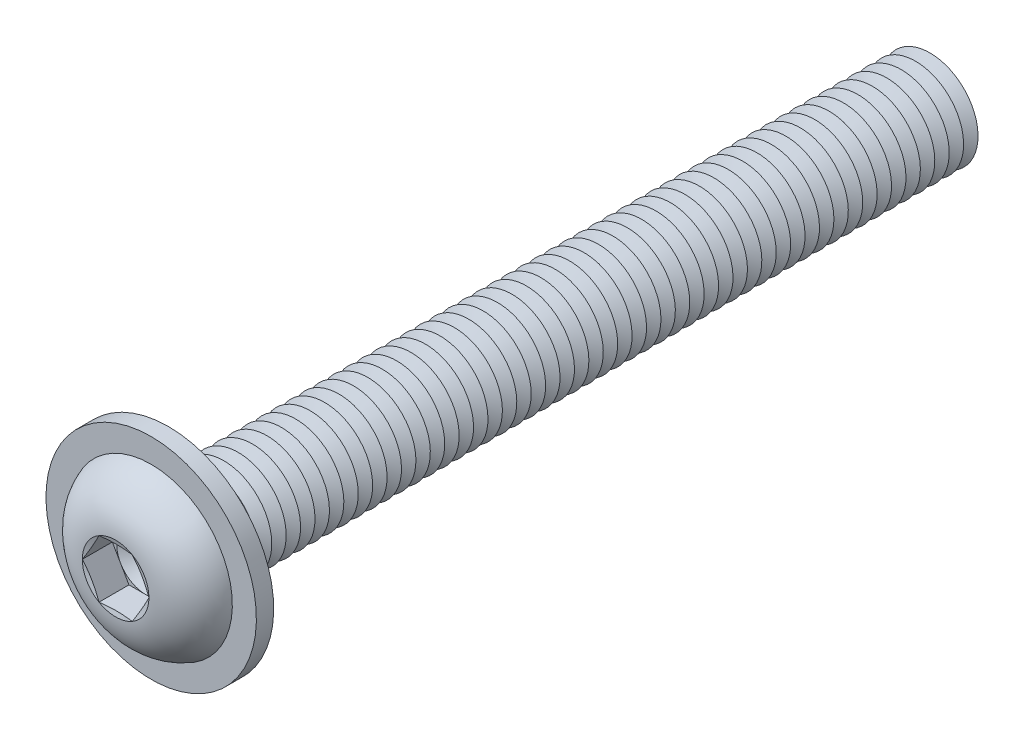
ISO-10303-21;
HEADER;
FILE_DESCRIPTION(('STEP AP214'),'2;1');
FILE_NAME('part.step','',(''),(''),'','','');
FILE_SCHEMA(('AUTOMOTIVE_DESIGN { 1 0 10303 214 1 1 1 1 }'));
ENDSEC;
DATA;
#1=APPLICATION_CONTEXT('core data for automotive mechanical design processes');
#2=APPLICATION_PROTOCOL_DEFINITION('international standard','automotive_design',2000,#1);
#3=PRODUCT_CONTEXT('',#1,'mechanical');
#4=PRODUCT('Part','Part','',(#3));
#5=PRODUCT_RELATED_PRODUCT_CATEGORY('part','',(#4));
#6=PRODUCT_DEFINITION_FORMATION('','',#4);
#7=PRODUCT_DEFINITION_CONTEXT('part definition',#1,'design');
#8=PRODUCT_DEFINITION('design','',#6,#7);
#9=PRODUCT_DEFINITION_SHAPE('','',#8);
#10=(LENGTH_UNIT() NAMED_UNIT(*) SI_UNIT(.MILLI.,.METRE.));
#11=(NAMED_UNIT(*) PLANE_ANGLE_UNIT() SI_UNIT($,.RADIAN.));
#12=(NAMED_UNIT(*) SI_UNIT($,.STERADIAN.) SOLID_ANGLE_UNIT());
#13=UNCERTAINTY_MEASURE_WITH_UNIT(LENGTH_MEASURE(1.E-05),#10,'distance_accuracy_value','');
#14=(GEOMETRIC_REPRESENTATION_CONTEXT(3) GLOBAL_UNCERTAINTY_ASSIGNED_CONTEXT((#13)) GLOBAL_UNIT_ASSIGNED_CONTEXT((#10,
#11,#12)) REPRESENTATION_CONTEXT('',''));
#15=CARTESIAN_POINT('',(0.,0.,0.));
#16=DIRECTION('',(0.,0.,1.));
#17=DIRECTION('',(1.,0.,0.));
#18=AXIS2_PLACEMENT_3D('',#15,#16,#17);
#19=CARTESIAN_POINT('',(0.,0.,-74.75));
#20=DIRECTION('',(0.,0.,1.));
#21=DIRECTION('',(0.,-1.,0.));
#22=AXIS2_PLACEMENT_3D('',#19,#20,#21);
#23=CONICAL_SURFACE('',#22,4.99999999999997,1.0471975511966);
#24=CARTESIAN_POINT('',(0.,0.,-75.5));
#25=DIRECTION('',(0.,0.,1.));
#26=DIRECTION('',(0.,-1.,0.));
#27=AXIS2_PLACEMENT_3D('',#24,#25,#26);
#28=CIRCLE('',#27,3.70096189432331);
#29=CARTESIAN_POINT('',(0.,-3.70096189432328,-75.5));
#30=VERTEX_POINT('',#29);
#31=EDGE_CURVE('E331',#30,#30,#28,.T.);
#32=ORIENTED_EDGE('',*,*,#31,.T.);
#33=EDGE_LOOP('',(#32));
#34=FACE_BOUND('',#33,.T.);
#35=CARTESIAN_POINT('',(0.,0.,-74.75));
#36=DIRECTION('',(0.,0.,1.));
#37=DIRECTION('',(0.,-1.,0.));
#38=AXIS2_PLACEMENT_3D('',#35,#36,#37);
#39=CIRCLE('',#38,4.99999999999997);
#40=CARTESIAN_POINT('',(0.,-4.99999999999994,-74.75));
#41=VERTEX_POINT('',#40);
#42=EDGE_CURVE('E356',#41,#41,#39,.T.);
#43=ORIENTED_EDGE('',*,*,#42,.F.);
#44=EDGE_LOOP('',(#43));
#45=FACE_BOUND('',#44,.T.);
#46=ADVANCED_FACE('F39',(#34,#45),#23,.T.);
#47=CARTESIAN_POINT('',(0.,0.,-75.5));
#48=DIRECTION('',(0.,0.,-1.));
#49=DIRECTION('',(0.,1.,0.));
#50=AXIS2_PLACEMENT_3D('',#47,#48,#49);
#51=CONICAL_SURFACE('',#50,3.70096189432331,1.0471975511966);
#52=CARTESIAN_POINT('',(0.,0.,-76.25));
#53=DIRECTION('',(0.,0.,1.));
#54=DIRECTION('',(0.,-1.,0.));
#55=AXIS2_PLACEMENT_3D('',#52,#53,#54);
#56=CIRCLE('',#55,4.99999999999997);
#57=CARTESIAN_POINT('',(0.,-4.99999999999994,-76.25));
#58=VERTEX_POINT('',#57);
#59=EDGE_CURVE('E327',#58,#58,#56,.T.);
#60=ORIENTED_EDGE('',*,*,#59,.T.);
#61=EDGE_LOOP('',(#60));
#62=FACE_BOUND('',#61,.T.);
#63=ORIENTED_EDGE('',*,*,#31,.F.);
#64=EDGE_LOOP('',(#63));
#65=FACE_BOUND('',#64,.T.);
#66=ADVANCED_FACE('F738',(#62,#65),#51,.T.);
#67=CARTESIAN_POINT('',(0.,4.99999999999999,-80.));
#68=DIRECTION('',(0.,0.,-1.));
#69=DIRECTION('',(0.,1.,0.));
#70=AXIS2_PLACEMENT_3D('',#67,#68,#69);
#71=PLANE('',#70);
#72=CARTESIAN_POINT('',(0.,0.,-80.));
#73=DIRECTION('',(0.,0.,1.));
#74=DIRECTION('',(0.,-1.,0.));
#75=AXIS2_PLACEMENT_3D('',#72,#73,#74);
#76=CIRCLE('',#75,3.70096189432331);
#77=CARTESIAN_POINT('',(0.,-3.70096189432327,-80.));
#78=VERTEX_POINT('',#77);
#79=EDGE_CURVE('E324',#78,#78,#76,.T.);
#80=ORIENTED_EDGE('',*,*,#79,.F.);
#81=EDGE_LOOP('',(#80));
#82=FACE_BOUND('',#81,.T.);
#83=ADVANCED_FACE('F736',(#82),#71,.T.);
#84=CARTESIAN_POINT('',(0.,0.,-79.25));
#85=DIRECTION('',(0.,0.,1.));
#86=DIRECTION('',(0.,-1.,0.));
#87=AXIS2_PLACEMENT_3D('',#84,#85,#86);
#88=CONICAL_SURFACE('',#87,4.99999999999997,1.0471975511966);
#89=ORIENTED_EDGE('',*,*,#79,.T.);
#90=EDGE_LOOP('',(#89));
#91=FACE_BOUND('',#90,.T.);
#92=CARTESIAN_POINT('',(0.,0.,-79.25));
#93=DIRECTION('',(0.,0.,1.));
#94=DIRECTION('',(0.,-1.,0.));
#95=AXIS2_PLACEMENT_3D('',#92,#93,#94);
#96=CIRCLE('',#95,4.99999999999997);
#97=CARTESIAN_POINT('',(0.,-4.99999999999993,-79.25));
#98=VERTEX_POINT('',#97);
#99=EDGE_CURVE('E726',#98,#98,#96,.T.);
#100=ORIENTED_EDGE('',*,*,#99,.F.);
#101=EDGE_LOOP('',(#100));
#102=FACE_BOUND('',#101,.T.);
#103=ADVANCED_FACE('F733',(#91,#102),#88,.T.);
#104=CARTESIAN_POINT('',(0.,0.,-78.5));
#105=DIRECTION('',(0.,0.,-1.));
#106=DIRECTION('',(0.,1.,0.));
#107=AXIS2_PLACEMENT_3D('',#104,#105,#106);
#108=CONICAL_SURFACE('',#107,3.70096189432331,1.0471975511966);
#109=ORIENTED_EDGE('',*,*,#99,.T.);
#110=EDGE_LOOP('',(#109));
#111=FACE_BOUND('',#110,.T.);
#112=CARTESIAN_POINT('',(0.,0.,-78.5));
#113=DIRECTION('',(0.,0.,1.));
#114=DIRECTION('',(0.,-1.,0.));
#115=AXIS2_PLACEMENT_3D('',#112,#113,#114);
#116=CIRCLE('',#115,3.70096189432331);
#117=CARTESIAN_POINT('',(0.,-3.70096189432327,-78.5));
#118=VERTEX_POINT('',#117);
#119=EDGE_CURVE('E722',#118,#118,#116,.T.);
#120=ORIENTED_EDGE('',*,*,#119,.F.);
#121=EDGE_LOOP('',(#120));
#122=FACE_BOUND('',#121,.T.);
#123=ADVANCED_FACE('F743',(#111,#122),#108,.T.);
#124=CARTESIAN_POINT('',(0.,0.,-77.75));
#125=DIRECTION('',(0.,0.,1.));
#126=DIRECTION('',(0.,-1.,0.));
#127=AXIS2_PLACEMENT_3D('',#124,#125,#126);
#128=CONICAL_SURFACE('',#127,4.99999999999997,1.0471975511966);
#129=ORIENTED_EDGE('',*,*,#119,.T.);
#130=EDGE_LOOP('',(#129));
#131=FACE_BOUND('',#130,.T.);
#132=CARTESIAN_POINT('',(0.,0.,-77.75));
#133=DIRECTION('',(0.,0.,1.));
#134=DIRECTION('',(0.,-1.,0.));
#135=AXIS2_PLACEMENT_3D('',#132,#133,#134);
#136=CIRCLE('',#135,4.99999999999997);
#137=CARTESIAN_POINT('',(0.,-4.99999999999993,-77.75));
#138=VERTEX_POINT('',#137);
#139=EDGE_CURVE('E718',#138,#138,#136,.T.);
#140=ORIENTED_EDGE('',*,*,#139,.F.);
#141=EDGE_LOOP('',(#140));
#142=FACE_BOUND('',#141,.T.);
#143=ADVANCED_FACE('F759',(#131,#142),#128,.T.);
#144=CARTESIAN_POINT('',(0.,0.,-77.));
#145=DIRECTION('',(0.,0.,-1.));
#146=DIRECTION('',(0.,1.,0.));
#147=AXIS2_PLACEMENT_3D('',#144,#145,#146);
#148=CONICAL_SURFACE('',#147,3.70096189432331,1.0471975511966);
#149=ORIENTED_EDGE('',*,*,#139,.T.);
#150=EDGE_LOOP('',(#149));
#151=FACE_BOUND('',#150,.T.);
#152=CARTESIAN_POINT('',(0.,0.,-77.));
#153=DIRECTION('',(0.,0.,1.));
#154=DIRECTION('',(0.,-1.,0.));
#155=AXIS2_PLACEMENT_3D('',#152,#153,#154);
#156=CIRCLE('',#155,3.70096189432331);
#157=CARTESIAN_POINT('',(0.,-3.70096189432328,-77.));
#158=VERTEX_POINT('',#157);
#159=EDGE_CURVE('E330',#158,#158,#156,.T.);
#160=ORIENTED_EDGE('',*,*,#159,.F.);
#161=EDGE_LOOP('',(#160));
#162=FACE_BOUND('',#161,.T.);
#163=ADVANCED_FACE('F755',(#151,#162),#148,.T.);
#164=CARTESIAN_POINT('',(0.,0.,-76.25));
#165=DIRECTION('',(0.,0.,1.));
#166=DIRECTION('',(0.,-1.,0.));
#167=AXIS2_PLACEMENT_3D('',#164,#165,#166);
#168=CONICAL_SURFACE('',#167,4.99999999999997,1.0471975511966);
#169=ORIENTED_EDGE('',*,*,#159,.T.);
#170=EDGE_LOOP('',(#169));
#171=FACE_BOUND('',#170,.T.);
#172=ORIENTED_EDGE('',*,*,#59,.F.);
#173=EDGE_LOOP('',(#172));
#174=FACE_BOUND('',#173,.T.);
#175=ADVANCED_FACE('F758',(#171,#174),#168,.T.);
#176=CARTESIAN_POINT('',(0.,0.,-73.25));
#177=DIRECTION('',(0.,0.,1.));
#178=DIRECTION('',(0.,-1.,0.));
#179=AXIS2_PLACEMENT_3D('',#176,#177,#178);
#180=CONICAL_SURFACE('',#179,4.99999999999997,1.0471975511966);
#181=CARTESIAN_POINT('',(0.,0.,-74.));
#182=DIRECTION('',(0.,0.,1.));
#183=DIRECTION('',(0.,-1.,0.));
#184=AXIS2_PLACEMENT_3D('',#181,#182,#183);
#185=CIRCLE('',#184,3.70096189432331);
#186=CARTESIAN_POINT('',(0.,-3.70096189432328,-74.));
#187=VERTEX_POINT('',#186);
#188=EDGE_CURVE('E359',#187,#187,#185,.T.);
#189=ORIENTED_EDGE('',*,*,#188,.T.);
#190=EDGE_LOOP('',(#189));
#191=FACE_BOUND('',#190,.T.);
#192=CARTESIAN_POINT('',(0.,0.,-73.25));
#193=DIRECTION('',(0.,0.,1.));
#194=DIRECTION('',(0.,-1.,0.));
#195=AXIS2_PLACEMENT_3D('',#192,#193,#194);
#196=CIRCLE('',#195,4.99999999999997);
#197=CARTESIAN_POINT('',(0.,-4.99999999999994,-73.25));
#198=VERTEX_POINT('',#197);
#199=EDGE_CURVE('E705',#198,#198,#196,.T.);
#200=ORIENTED_EDGE('',*,*,#199,.F.);
#201=EDGE_LOOP('',(#200));
#202=FACE_BOUND('',#201,.T.);
#203=ADVANCED_FACE('F763',(#191,#202),#180,.T.);
#204=CARTESIAN_POINT('',(0.,0.,-74.));
#205=DIRECTION('',(0.,0.,-1.));
#206=DIRECTION('',(0.,1.,0.));
#207=AXIS2_PLACEMENT_3D('',#204,#205,#206);
#208=CONICAL_SURFACE('',#207,3.70096189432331,1.0471975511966);
#209=ORIENTED_EDGE('',*,*,#42,.T.);
#210=EDGE_LOOP('',(#209));
#211=FACE_BOUND('',#210,.T.);
#212=ORIENTED_EDGE('',*,*,#188,.F.);
#213=EDGE_LOOP('',(#212));
#214=FACE_BOUND('',#213,.T.);
#215=ADVANCED_FACE('F795',(#211,#214),#208,.T.);
#216=CARTESIAN_POINT('',(0.,0.,-71.75));
#217=DIRECTION('',(0.,0.,1.));
#218=DIRECTION('',(0.,-1.,0.));
#219=AXIS2_PLACEMENT_3D('',#216,#217,#218);
#220=CONICAL_SURFACE('',#219,4.99999999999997,1.0471975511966);
#221=CARTESIAN_POINT('',(0.,0.,-72.5));
#222=DIRECTION('',(0.,0.,1.));
#223=DIRECTION('',(0.,-1.,0.));
#224=AXIS2_PLACEMENT_3D('',#221,#222,#223);
#225=CIRCLE('',#224,3.70096189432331);
#226=CARTESIAN_POINT('',(0.,-3.70096189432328,-72.5));
#227=VERTEX_POINT('',#226);
#228=EDGE_CURVE('E702',#227,#227,#225,.T.);
#229=ORIENTED_EDGE('',*,*,#228,.T.);
#230=EDGE_LOOP('',(#229));
#231=FACE_BOUND('',#230,.T.);
#232=CARTESIAN_POINT('',(0.,0.,-71.75));
#233=DIRECTION('',(0.,0.,1.));
#234=DIRECTION('',(0.,-1.,0.));
#235=AXIS2_PLACEMENT_3D('',#232,#233,#234);
#236=CIRCLE('',#235,4.99999999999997);
#237=CARTESIAN_POINT('',(0.,-4.99999999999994,-71.75));
#238=VERTEX_POINT('',#237);
#239=EDGE_CURVE('E698',#238,#238,#236,.T.);
#240=ORIENTED_EDGE('',*,*,#239,.F.);
#241=EDGE_LOOP('',(#240));
#242=FACE_BOUND('',#241,.T.);
#243=ADVANCED_FACE('F801',(#231,#242),#220,.T.);
#244=CARTESIAN_POINT('',(0.,0.,-72.5));
#245=DIRECTION('',(0.,0.,-1.));
#246=DIRECTION('',(0.,1.,0.));
#247=AXIS2_PLACEMENT_3D('',#244,#245,#246);
#248=CONICAL_SURFACE('',#247,3.70096189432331,1.0471975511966);
#249=ORIENTED_EDGE('',*,*,#199,.T.);
#250=EDGE_LOOP('',(#249));
#251=FACE_BOUND('',#250,.T.);
#252=ORIENTED_EDGE('',*,*,#228,.F.);
#253=EDGE_LOOP('',(#252));
#254=FACE_BOUND('',#253,.T.);
#255=ADVANCED_FACE('F808',(#251,#254),#248,.T.);
#256=CARTESIAN_POINT('',(0.,0.,-70.25));
#257=DIRECTION('',(0.,0.,1.));
#258=DIRECTION('',(0.,-1.,0.));
#259=AXIS2_PLACEMENT_3D('',#256,#257,#258);
#260=CONICAL_SURFACE('',#259,4.99999999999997,1.0471975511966);
#261=CARTESIAN_POINT('',(0.,0.,-71.));
#262=DIRECTION('',(0.,0.,1.));
#263=DIRECTION('',(0.,-1.,0.));
#264=AXIS2_PLACEMENT_3D('',#261,#262,#263);
#265=CIRCLE('',#264,3.70096189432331);
#266=CARTESIAN_POINT('',(0.,-3.70096189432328,-71.));
#267=VERTEX_POINT('',#266);
#268=EDGE_CURVE('E694',#267,#267,#265,.T.);
#269=ORIENTED_EDGE('',*,*,#268,.T.);
#270=EDGE_LOOP('',(#269));
#271=FACE_BOUND('',#270,.T.);
#272=CARTESIAN_POINT('',(0.,0.,-70.25));
#273=DIRECTION('',(0.,0.,1.));
#274=DIRECTION('',(0.,-1.,0.));
#275=AXIS2_PLACEMENT_3D('',#272,#273,#274);
#276=CIRCLE('',#275,4.99999999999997);
#277=CARTESIAN_POINT('',(0.,-4.99999999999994,-70.25));
#278=VERTEX_POINT('',#277);
#279=EDGE_CURVE('E690',#278,#278,#276,.T.);
#280=ORIENTED_EDGE('',*,*,#279,.F.);
#281=EDGE_LOOP('',(#280));
#282=FACE_BOUND('',#281,.T.);
#283=ADVANCED_FACE('F815',(#271,#282),#260,.T.);
#284=CARTESIAN_POINT('',(0.,0.,-71.));
#285=DIRECTION('',(0.,0.,-1.));
#286=DIRECTION('',(0.,1.,0.));
#287=AXIS2_PLACEMENT_3D('',#284,#285,#286);
#288=CONICAL_SURFACE('',#287,3.70096189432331,1.0471975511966);
#289=ORIENTED_EDGE('',*,*,#239,.T.);
#290=EDGE_LOOP('',(#289));
#291=FACE_BOUND('',#290,.T.);
#292=ORIENTED_EDGE('',*,*,#268,.F.);
#293=EDGE_LOOP('',(#292));
#294=FACE_BOUND('',#293,.T.);
#295=ADVANCED_FACE('F822',(#291,#294),#288,.T.);
#296=CARTESIAN_POINT('',(0.,0.,-68.75));
#297=DIRECTION('',(0.,0.,1.));
#298=DIRECTION('',(0.,-1.,0.));
#299=AXIS2_PLACEMENT_3D('',#296,#297,#298);
#300=CONICAL_SURFACE('',#299,4.99999999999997,1.0471975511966);
#301=CARTESIAN_POINT('',(0.,0.,-69.5));
#302=DIRECTION('',(0.,0.,1.));
#303=DIRECTION('',(0.,-1.,0.));
#304=AXIS2_PLACEMENT_3D('',#301,#302,#303);
#305=CIRCLE('',#304,3.70096189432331);
#306=CARTESIAN_POINT('',(0.,-3.70096189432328,-69.5));
#307=VERTEX_POINT('',#306);
#308=EDGE_CURVE('E686',#307,#307,#305,.T.);
#309=ORIENTED_EDGE('',*,*,#308,.T.);
#310=EDGE_LOOP('',(#309));
#311=FACE_BOUND('',#310,.T.);
#312=CARTESIAN_POINT('',(0.,0.,-68.75));
#313=DIRECTION('',(0.,0.,1.));
#314=DIRECTION('',(0.,-1.,0.));
#315=AXIS2_PLACEMENT_3D('',#312,#313,#314);
#316=CIRCLE('',#315,4.99999999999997);
#317=CARTESIAN_POINT('',(0.,-4.99999999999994,-68.75));
#318=VERTEX_POINT('',#317);
#319=EDGE_CURVE('E682',#318,#318,#316,.T.);
#320=ORIENTED_EDGE('',*,*,#319,.F.);
#321=EDGE_LOOP('',(#320));
#322=FACE_BOUND('',#321,.T.);
#323=ADVANCED_FACE('F829',(#311,#322),#300,.T.);
#324=CARTESIAN_POINT('',(0.,0.,-69.5));
#325=DIRECTION('',(0.,0.,-1.));
#326=DIRECTION('',(0.,1.,0.));
#327=AXIS2_PLACEMENT_3D('',#324,#325,#326);
#328=CONICAL_SURFACE('',#327,3.70096189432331,1.0471975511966);
#329=ORIENTED_EDGE('',*,*,#279,.T.);
#330=EDGE_LOOP('',(#329));
#331=FACE_BOUND('',#330,.T.);
#332=ORIENTED_EDGE('',*,*,#308,.F.);
#333=EDGE_LOOP('',(#332));
#334=FACE_BOUND('',#333,.T.);
#335=ADVANCED_FACE('F836',(#331,#334),#328,.T.);
#336=CARTESIAN_POINT('',(0.,0.,-67.25));
#337=DIRECTION('',(0.,0.,1.));
#338=DIRECTION('',(0.,-1.,0.));
#339=AXIS2_PLACEMENT_3D('',#336,#337,#338);
#340=CONICAL_SURFACE('',#339,4.99999999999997,1.0471975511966);
#341=CARTESIAN_POINT('',(0.,0.,-68.));
#342=DIRECTION('',(0.,0.,1.));
#343=DIRECTION('',(0.,-1.,0.));
#344=AXIS2_PLACEMENT_3D('',#341,#342,#343);
#345=CIRCLE('',#344,3.70096189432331);
#346=CARTESIAN_POINT('',(0.,-3.70096189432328,-68.));
#347=VERTEX_POINT('',#346);
#348=EDGE_CURVE('E679',#347,#347,#345,.T.);
#349=ORIENTED_EDGE('',*,*,#348,.T.);
#350=EDGE_LOOP('',(#349));
#351=FACE_BOUND('',#350,.T.);
#352=CARTESIAN_POINT('',(0.,0.,-67.25));
#353=DIRECTION('',(0.,0.,1.));
#354=DIRECTION('',(0.,-1.,0.));
#355=AXIS2_PLACEMENT_3D('',#352,#353,#354);
#356=CIRCLE('',#355,4.99999999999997);
#357=CARTESIAN_POINT('',(0.,-4.99999999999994,-67.25));
#358=VERTEX_POINT('',#357);
#359=EDGE_CURVE('E675',#358,#358,#356,.T.);
#360=ORIENTED_EDGE('',*,*,#359,.F.);
#361=EDGE_LOOP('',(#360));
#362=FACE_BOUND('',#361,.T.);
#363=ADVANCED_FACE('F843',(#351,#362),#340,.T.);
#364=CARTESIAN_POINT('',(0.,0.,-68.));
#365=DIRECTION('',(0.,0.,-1.));
#366=DIRECTION('',(0.,1.,0.));
#367=AXIS2_PLACEMENT_3D('',#364,#365,#366);
#368=CONICAL_SURFACE('',#367,3.70096189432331,1.0471975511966);
#369=ORIENTED_EDGE('',*,*,#319,.T.);
#370=EDGE_LOOP('',(#369));
#371=FACE_BOUND('',#370,.T.);
#372=ORIENTED_EDGE('',*,*,#348,.F.);
#373=EDGE_LOOP('',(#372));
#374=FACE_BOUND('',#373,.T.);
#375=ADVANCED_FACE('F850',(#371,#374),#368,.T.);
#376=CARTESIAN_POINT('',(0.,0.,-65.75));
#377=DIRECTION('',(0.,0.,1.));
#378=DIRECTION('',(0.,-1.,0.));
#379=AXIS2_PLACEMENT_3D('',#376,#377,#378);
#380=CONICAL_SURFACE('',#379,4.99999999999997,1.0471975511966);
#381=CARTESIAN_POINT('',(0.,0.,-66.5));
#382=DIRECTION('',(0.,0.,1.));
#383=DIRECTION('',(0.,-1.,0.));
#384=AXIS2_PLACEMENT_3D('',#381,#382,#383);
#385=CIRCLE('',#384,3.70096189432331);
#386=CARTESIAN_POINT('',(0.,-3.70096189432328,-66.5));
#387=VERTEX_POINT('',#386);
#388=EDGE_CURVE('E671',#387,#387,#385,.T.);
#389=ORIENTED_EDGE('',*,*,#388,.T.);
#390=EDGE_LOOP('',(#389));
#391=FACE_BOUND('',#390,.T.);
#392=CARTESIAN_POINT('',(0.,0.,-65.75));
#393=DIRECTION('',(0.,0.,1.));
#394=DIRECTION('',(0.,-1.,0.));
#395=AXIS2_PLACEMENT_3D('',#392,#393,#394);
#396=CIRCLE('',#395,4.99999999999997);
#397=CARTESIAN_POINT('',(0.,-4.99999999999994,-65.75));
#398=VERTEX_POINT('',#397);
#399=EDGE_CURVE('E667',#398,#398,#396,.T.);
#400=ORIENTED_EDGE('',*,*,#399,.F.);
#401=EDGE_LOOP('',(#400));
#402=FACE_BOUND('',#401,.T.);
#403=ADVANCED_FACE('F857',(#391,#402),#380,.T.);
#404=CARTESIAN_POINT('',(0.,0.,-66.5));
#405=DIRECTION('',(0.,0.,-1.));
#406=DIRECTION('',(0.,1.,0.));
#407=AXIS2_PLACEMENT_3D('',#404,#405,#406);
#408=CONICAL_SURFACE('',#407,3.70096189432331,1.0471975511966);
#409=ORIENTED_EDGE('',*,*,#359,.T.);
#410=EDGE_LOOP('',(#409));
#411=FACE_BOUND('',#410,.T.);
#412=ORIENTED_EDGE('',*,*,#388,.F.);
#413=EDGE_LOOP('',(#412));
#414=FACE_BOUND('',#413,.T.);
#415=ADVANCED_FACE('F864',(#411,#414),#408,.T.);
#416=CARTESIAN_POINT('',(0.,0.,-64.25));
#417=DIRECTION('',(0.,0.,1.));
#418=DIRECTION('',(0.,-1.,0.));
#419=AXIS2_PLACEMENT_3D('',#416,#417,#418);
#420=CONICAL_SURFACE('',#419,4.99999999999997,1.0471975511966);
#421=CARTESIAN_POINT('',(0.,0.,-65.));
#422=DIRECTION('',(0.,0.,1.));
#423=DIRECTION('',(0.,-1.,0.));
#424=AXIS2_PLACEMENT_3D('',#421,#422,#423);
#425=CIRCLE('',#424,3.70096189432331);
#426=CARTESIAN_POINT('',(0.,-3.70096189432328,-65.));
#427=VERTEX_POINT('',#426);
#428=EDGE_CURVE('E663',#427,#427,#425,.T.);
#429=ORIENTED_EDGE('',*,*,#428,.T.);
#430=EDGE_LOOP('',(#429));
#431=FACE_BOUND('',#430,.T.);
#432=CARTESIAN_POINT('',(0.,0.,-64.25));
#433=DIRECTION('',(0.,0.,1.));
#434=DIRECTION('',(0.,-1.,0.));
#435=AXIS2_PLACEMENT_3D('',#432,#433,#434);
#436=CIRCLE('',#435,4.99999999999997);
#437=CARTESIAN_POINT('',(0.,-4.99999999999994,-64.25));
#438=VERTEX_POINT('',#437);
#439=EDGE_CURVE('E336',#438,#438,#436,.T.);
#440=ORIENTED_EDGE('',*,*,#439,.F.);
#441=EDGE_LOOP('',(#440));
#442=FACE_BOUND('',#441,.T.);
#443=ADVANCED_FACE('F871',(#431,#442),#420,.T.);
#444=CARTESIAN_POINT('',(0.,0.,-65.));
#445=DIRECTION('',(0.,0.,-1.));
#446=DIRECTION('',(0.,1.,0.));
#447=AXIS2_PLACEMENT_3D('',#444,#445,#446);
#448=CONICAL_SURFACE('',#447,3.70096189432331,1.0471975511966);
#449=ORIENTED_EDGE('',*,*,#399,.T.);
#450=EDGE_LOOP('',(#449));
#451=FACE_BOUND('',#450,.T.);
#452=ORIENTED_EDGE('',*,*,#428,.F.);
#453=EDGE_LOOP('',(#452));
#454=FACE_BOUND('',#453,.T.);
#455=ADVANCED_FACE('F878',(#451,#454),#448,.T.);
#456=CARTESIAN_POINT('',(0.,0.,-62.75));
#457=DIRECTION('',(0.,0.,1.));
#458=DIRECTION('',(0.,-1.,0.));
#459=AXIS2_PLACEMENT_3D('',#456,#457,#458);
#460=CONICAL_SURFACE('',#459,4.99999999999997,1.0471975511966);
#461=CARTESIAN_POINT('',(0.,0.,-63.5));
#462=DIRECTION('',(0.,0.,1.));
#463=DIRECTION('',(0.,-1.,0.));
#464=AXIS2_PLACEMENT_3D('',#461,#462,#463);
#465=CIRCLE('',#464,3.70096189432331);
#466=CARTESIAN_POINT('',(0.,-3.70096189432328,-63.5));
#467=VERTEX_POINT('',#466);
#468=EDGE_CURVE('E333',#467,#467,#465,.T.);
#469=ORIENTED_EDGE('',*,*,#468,.T.);
#470=EDGE_LOOP('',(#469));
#471=FACE_BOUND('',#470,.T.);
#472=CARTESIAN_POINT('',(0.,0.,-62.75));
#473=DIRECTION('',(0.,0.,1.));
#474=DIRECTION('',(0.,-1.,0.));
#475=AXIS2_PLACEMENT_3D('',#472,#473,#474);
#476=CIRCLE('',#475,4.99999999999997);
#477=CARTESIAN_POINT('',(0.,-4.99999999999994,-62.75));
#478=VERTEX_POINT('',#477);
#479=EDGE_CURVE('E337',#478,#478,#476,.T.);
#480=ORIENTED_EDGE('',*,*,#479,.F.);
#481=EDGE_LOOP('',(#480));
#482=FACE_BOUND('',#481,.T.);
#483=ADVANCED_FACE('F885',(#471,#482),#460,.T.);
#484=CARTESIAN_POINT('',(0.,0.,-63.5));
#485=DIRECTION('',(0.,0.,-1.));
#486=DIRECTION('',(0.,1.,0.));
#487=AXIS2_PLACEMENT_3D('',#484,#485,#486);
#488=CONICAL_SURFACE('',#487,3.70096189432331,1.0471975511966);
#489=ORIENTED_EDGE('',*,*,#439,.T.);
#490=EDGE_LOOP('',(#489));
#491=FACE_BOUND('',#490,.T.);
#492=ORIENTED_EDGE('',*,*,#468,.F.);
#493=EDGE_LOOP('',(#492));
#494=FACE_BOUND('',#493,.T.);
#495=ADVANCED_FACE('F892',(#491,#494),#488,.T.);
#496=CARTESIAN_POINT('',(0.,0.,-61.25));
#497=DIRECTION('',(0.,0.,1.));
#498=DIRECTION('',(0.,-1.,0.));
#499=AXIS2_PLACEMENT_3D('',#496,#497,#498);
#500=CONICAL_SURFACE('',#499,4.99999999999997,1.0471975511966);
#501=CARTESIAN_POINT('',(0.,0.,-62.));
#502=DIRECTION('',(0.,0.,1.));
#503=DIRECTION('',(0.,-1.,0.));
#504=AXIS2_PLACEMENT_3D('',#501,#502,#503);
#505=CIRCLE('',#504,3.70096189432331);
#506=CARTESIAN_POINT('',(0.,-3.70096189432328,-62.));
#507=VERTEX_POINT('',#506);
#508=EDGE_CURVE('E653',#507,#507,#505,.T.);
#509=ORIENTED_EDGE('',*,*,#508,.T.);
#510=EDGE_LOOP('',(#509));
#511=FACE_BOUND('',#510,.T.);
#512=CARTESIAN_POINT('',(0.,0.,-61.25));
#513=DIRECTION('',(0.,0.,1.));
#514=DIRECTION('',(0.,-1.,0.));
#515=AXIS2_PLACEMENT_3D('',#512,#513,#514);
#516=CIRCLE('',#515,4.99999999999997);
#517=CARTESIAN_POINT('',(0.,-4.99999999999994,-61.25));
#518=VERTEX_POINT('',#517);
#519=EDGE_CURVE('E649',#518,#518,#516,.T.);
#520=ORIENTED_EDGE('',*,*,#519,.F.);
#521=EDGE_LOOP('',(#520));
#522=FACE_BOUND('',#521,.T.);
#523=ADVANCED_FACE('F899',(#511,#522),#500,.T.);
#524=CARTESIAN_POINT('',(0.,0.,-62.));
#525=DIRECTION('',(0.,0.,-1.));
#526=DIRECTION('',(0.,1.,0.));
#527=AXIS2_PLACEMENT_3D('',#524,#525,#526);
#528=CONICAL_SURFACE('',#527,3.70096189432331,1.0471975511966);
#529=ORIENTED_EDGE('',*,*,#479,.T.);
#530=EDGE_LOOP('',(#529));
#531=FACE_BOUND('',#530,.T.);
#532=ORIENTED_EDGE('',*,*,#508,.F.);
#533=EDGE_LOOP('',(#532));
#534=FACE_BOUND('',#533,.T.);
#535=ADVANCED_FACE('F906',(#531,#534),#528,.T.);
#536=CARTESIAN_POINT('',(0.,0.,-59.75));
#537=DIRECTION('',(0.,0.,1.));
#538=DIRECTION('',(0.,-1.,0.));
#539=AXIS2_PLACEMENT_3D('',#536,#537,#538);
#540=CONICAL_SURFACE('',#539,4.99999999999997,1.0471975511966);
#541=CARTESIAN_POINT('',(0.,0.,-60.5));
#542=DIRECTION('',(0.,0.,1.));
#543=DIRECTION('',(0.,-1.,0.));
#544=AXIS2_PLACEMENT_3D('',#541,#542,#543);
#545=CIRCLE('',#544,3.70096189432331);
#546=CARTESIAN_POINT('',(0.,-3.70096189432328,-60.5));
#547=VERTEX_POINT('',#546);
#548=EDGE_CURVE('E645',#547,#547,#545,.T.);
#549=ORIENTED_EDGE('',*,*,#548,.T.);
#550=EDGE_LOOP('',(#549));
#551=FACE_BOUND('',#550,.T.);
#552=CARTESIAN_POINT('',(0.,0.,-59.75));
#553=DIRECTION('',(0.,0.,1.));
#554=DIRECTION('',(0.,-1.,0.));
#555=AXIS2_PLACEMENT_3D('',#552,#553,#554);
#556=CIRCLE('',#555,4.99999999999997);
#557=CARTESIAN_POINT('',(0.,-4.99999999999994,-59.75));
#558=VERTEX_POINT('',#557);
#559=EDGE_CURVE('E641',#558,#558,#556,.T.);
#560=ORIENTED_EDGE('',*,*,#559,.F.);
#561=EDGE_LOOP('',(#560));
#562=FACE_BOUND('',#561,.T.);
#563=ADVANCED_FACE('F913',(#551,#562),#540,.T.);
#564=CARTESIAN_POINT('',(0.,0.,-60.5));
#565=DIRECTION('',(0.,0.,-1.));
#566=DIRECTION('',(0.,1.,0.));
#567=AXIS2_PLACEMENT_3D('',#564,#565,#566);
#568=CONICAL_SURFACE('',#567,3.70096189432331,1.0471975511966);
#569=ORIENTED_EDGE('',*,*,#519,.T.);
#570=EDGE_LOOP('',(#569));
#571=FACE_BOUND('',#570,.T.);
#572=ORIENTED_EDGE('',*,*,#548,.F.);
#573=EDGE_LOOP('',(#572));
#574=FACE_BOUND('',#573,.T.);
#575=ADVANCED_FACE('F920',(#571,#574),#568,.T.);
#576=CARTESIAN_POINT('',(0.,0.,-58.25));
#577=DIRECTION('',(0.,0.,1.));
#578=DIRECTION('',(0.,-1.,0.));
#579=AXIS2_PLACEMENT_3D('',#576,#577,#578);
#580=CONICAL_SURFACE('',#579,4.99999999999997,1.0471975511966);
#581=CARTESIAN_POINT('',(0.,0.,-59.));
#582=DIRECTION('',(0.,0.,1.));
#583=DIRECTION('',(0.,-1.,0.));
#584=AXIS2_PLACEMENT_3D('',#581,#582,#583);
#585=CIRCLE('',#584,3.70096189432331);
#586=CARTESIAN_POINT('',(0.,-3.70096189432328,-59.));
#587=VERTEX_POINT('',#586);
#588=EDGE_CURVE('E637',#587,#587,#585,.T.);
#589=ORIENTED_EDGE('',*,*,#588,.T.);
#590=EDGE_LOOP('',(#589));
#591=FACE_BOUND('',#590,.T.);
#592=CARTESIAN_POINT('',(0.,0.,-58.25));
#593=DIRECTION('',(0.,0.,1.));
#594=DIRECTION('',(0.,-1.,0.));
#595=AXIS2_PLACEMENT_3D('',#592,#593,#594);
#596=CIRCLE('',#595,4.99999999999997);
#597=CARTESIAN_POINT('',(0.,-4.99999999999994,-58.25));
#598=VERTEX_POINT('',#597);
#599=EDGE_CURVE('E633',#598,#598,#596,.T.);
#600=ORIENTED_EDGE('',*,*,#599,.F.);
#601=EDGE_LOOP('',(#600));
#602=FACE_BOUND('',#601,.T.);
#603=ADVANCED_FACE('F927',(#591,#602),#580,.T.);
#604=CARTESIAN_POINT('',(0.,0.,-59.));
#605=DIRECTION('',(0.,0.,-1.));
#606=DIRECTION('',(0.,1.,0.));
#607=AXIS2_PLACEMENT_3D('',#604,#605,#606);
#608=CONICAL_SURFACE('',#607,3.70096189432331,1.0471975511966);
#609=ORIENTED_EDGE('',*,*,#559,.T.);
#610=EDGE_LOOP('',(#609));
#611=FACE_BOUND('',#610,.T.);
#612=ORIENTED_EDGE('',*,*,#588,.F.);
#613=EDGE_LOOP('',(#612));
#614=FACE_BOUND('',#613,.T.);
#615=ADVANCED_FACE('F934',(#611,#614),#608,.T.);
#616=CARTESIAN_POINT('',(0.,0.,-56.75));
#617=DIRECTION('',(0.,0.,1.));
#618=DIRECTION('',(0.,-1.,0.));
#619=AXIS2_PLACEMENT_3D('',#616,#617,#618);
#620=CONICAL_SURFACE('',#619,4.99999999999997,1.0471975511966);
#621=CARTESIAN_POINT('',(0.,0.,-57.5));
#622=DIRECTION('',(0.,0.,1.));
#623=DIRECTION('',(0.,-1.,0.));
#624=AXIS2_PLACEMENT_3D('',#621,#622,#623);
#625=CIRCLE('',#624,3.70096189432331);
#626=CARTESIAN_POINT('',(0.,-3.70096189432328,-57.5));
#627=VERTEX_POINT('',#626);
#628=EDGE_CURVE('E629',#627,#627,#625,.T.);
#629=ORIENTED_EDGE('',*,*,#628,.T.);
#630=EDGE_LOOP('',(#629));
#631=FACE_BOUND('',#630,.T.);
#632=CARTESIAN_POINT('',(0.,0.,-56.75));
#633=DIRECTION('',(0.,0.,1.));
#634=DIRECTION('',(0.,-1.,0.));
#635=AXIS2_PLACEMENT_3D('',#632,#633,#634);
#636=CIRCLE('',#635,4.99999999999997);
#637=CARTESIAN_POINT('',(0.,-4.99999999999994,-56.75));
#638=VERTEX_POINT('',#637);
#639=EDGE_CURVE('E625',#638,#638,#636,.T.);
#640=ORIENTED_EDGE('',*,*,#639,.F.);
#641=EDGE_LOOP('',(#640));
#642=FACE_BOUND('',#641,.T.);
#643=ADVANCED_FACE('F941',(#631,#642),#620,.T.);
#644=CARTESIAN_POINT('',(0.,0.,-57.5));
#645=DIRECTION('',(0.,0.,-1.));
#646=DIRECTION('',(0.,1.,0.));
#647=AXIS2_PLACEMENT_3D('',#644,#645,#646);
#648=CONICAL_SURFACE('',#647,3.70096189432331,1.0471975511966);
#649=ORIENTED_EDGE('',*,*,#599,.T.);
#650=EDGE_LOOP('',(#649));
#651=FACE_BOUND('',#650,.T.);
#652=ORIENTED_EDGE('',*,*,#628,.F.);
#653=EDGE_LOOP('',(#652));
#654=FACE_BOUND('',#653,.T.);
#655=ADVANCED_FACE('F948',(#651,#654),#648,.T.);
#656=CARTESIAN_POINT('',(0.,0.,-55.25));
#657=DIRECTION('',(0.,0.,1.));
#658=DIRECTION('',(0.,-1.,0.));
#659=AXIS2_PLACEMENT_3D('',#656,#657,#658);
#660=CONICAL_SURFACE('',#659,4.99999999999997,1.0471975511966);
#661=CARTESIAN_POINT('',(0.,0.,-56.));
#662=DIRECTION('',(0.,0.,1.));
#663=DIRECTION('',(0.,-1.,0.));
#664=AXIS2_PLACEMENT_3D('',#661,#662,#663);
#665=CIRCLE('',#664,3.70096189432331);
#666=CARTESIAN_POINT('',(0.,-3.70096189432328,-56.));
#667=VERTEX_POINT('',#666);
#668=EDGE_CURVE('E621',#667,#667,#665,.T.);
#669=ORIENTED_EDGE('',*,*,#668,.T.);
#670=EDGE_LOOP('',(#669));
#671=FACE_BOUND('',#670,.T.);
#672=CARTESIAN_POINT('',(0.,0.,-55.25));
#673=DIRECTION('',(0.,0.,1.));
#674=DIRECTION('',(0.,-1.,0.));
#675=AXIS2_PLACEMENT_3D('',#672,#673,#674);
#676=CIRCLE('',#675,4.99999999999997);
#677=CARTESIAN_POINT('',(0.,-4.99999999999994,-55.25));
#678=VERTEX_POINT('',#677);
#679=EDGE_CURVE('E617',#678,#678,#676,.T.);
#680=ORIENTED_EDGE('',*,*,#679,.F.);
#681=EDGE_LOOP('',(#680));
#682=FACE_BOUND('',#681,.T.);
#683=ADVANCED_FACE('F955',(#671,#682),#660,.T.);
#684=CARTESIAN_POINT('',(0.,0.,-56.));
#685=DIRECTION('',(0.,0.,-1.));
#686=DIRECTION('',(0.,1.,0.));
#687=AXIS2_PLACEMENT_3D('',#684,#685,#686);
#688=CONICAL_SURFACE('',#687,3.70096189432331,1.0471975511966);
#689=ORIENTED_EDGE('',*,*,#639,.T.);
#690=EDGE_LOOP('',(#689));
#691=FACE_BOUND('',#690,.T.);
#692=ORIENTED_EDGE('',*,*,#668,.F.);
#693=EDGE_LOOP('',(#692));
#694=FACE_BOUND('',#693,.T.);
#695=ADVANCED_FACE('F962',(#691,#694),#688,.T.);
#696=CARTESIAN_POINT('',(0.,0.,-53.75));
#697=DIRECTION('',(0.,0.,1.));
#698=DIRECTION('',(0.,-1.,0.));
#699=AXIS2_PLACEMENT_3D('',#696,#697,#698);
#700=CONICAL_SURFACE('',#699,4.99999999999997,1.0471975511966);
#701=CARTESIAN_POINT('',(0.,0.,-54.5));
#702=DIRECTION('',(0.,0.,1.));
#703=DIRECTION('',(0.,-1.,0.));
#704=AXIS2_PLACEMENT_3D('',#701,#702,#703);
#705=CIRCLE('',#704,3.70096189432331);
#706=CARTESIAN_POINT('',(0.,-3.70096189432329,-54.5));
#707=VERTEX_POINT('',#706);
#708=EDGE_CURVE('E613',#707,#707,#705,.T.);
#709=ORIENTED_EDGE('',*,*,#708,.T.);
#710=EDGE_LOOP('',(#709));
#711=FACE_BOUND('',#710,.T.);
#712=CARTESIAN_POINT('',(0.,0.,-53.75));
#713=DIRECTION('',(0.,0.,1.));
#714=DIRECTION('',(0.,-1.,0.));
#715=AXIS2_PLACEMENT_3D('',#712,#713,#714);
#716=CIRCLE('',#715,4.99999999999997);
#717=CARTESIAN_POINT('',(0.,-4.99999999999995,-53.75));
#718=VERTEX_POINT('',#717);
#719=EDGE_CURVE('E609',#718,#718,#716,.T.);
#720=ORIENTED_EDGE('',*,*,#719,.F.);
#721=EDGE_LOOP('',(#720));
#722=FACE_BOUND('',#721,.T.);
#723=ADVANCED_FACE('F969',(#711,#722),#700,.T.);
#724=CARTESIAN_POINT('',(0.,0.,-54.5));
#725=DIRECTION('',(0.,0.,-1.));
#726=DIRECTION('',(0.,1.,0.));
#727=AXIS2_PLACEMENT_3D('',#724,#725,#726);
#728=CONICAL_SURFACE('',#727,3.70096189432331,1.0471975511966);
#729=ORIENTED_EDGE('',*,*,#679,.T.);
#730=EDGE_LOOP('',(#729));
#731=FACE_BOUND('',#730,.T.);
#732=ORIENTED_EDGE('',*,*,#708,.F.);
#733=EDGE_LOOP('',(#732));
#734=FACE_BOUND('',#733,.T.);
#735=ADVANCED_FACE('F976',(#731,#734),#728,.T.);
#736=CARTESIAN_POINT('',(0.,0.,-52.25));
#737=DIRECTION('',(0.,0.,1.));
#738=DIRECTION('',(0.,-1.,0.));
#739=AXIS2_PLACEMENT_3D('',#736,#737,#738);
#740=CONICAL_SURFACE('',#739,4.99999999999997,1.0471975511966);
#741=CARTESIAN_POINT('',(0.,0.,-53.));
#742=DIRECTION('',(0.,0.,1.));
#743=DIRECTION('',(0.,-1.,0.));
#744=AXIS2_PLACEMENT_3D('',#741,#742,#743);
#745=CIRCLE('',#744,3.70096189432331);
#746=CARTESIAN_POINT('',(0.,-3.70096189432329,-53.));
#747=VERTEX_POINT('',#746);
#748=EDGE_CURVE('E605',#747,#747,#745,.T.);
#749=ORIENTED_EDGE('',*,*,#748,.T.);
#750=EDGE_LOOP('',(#749));
#751=FACE_BOUND('',#750,.T.);
#752=CARTESIAN_POINT('',(0.,0.,-52.25));
#753=DIRECTION('',(0.,0.,1.));
#754=DIRECTION('',(0.,-1.,0.));
#755=AXIS2_PLACEMENT_3D('',#752,#753,#754);
#756=CIRCLE('',#755,4.99999999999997);
#757=CARTESIAN_POINT('',(0.,-4.99999999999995,-52.25));
#758=VERTEX_POINT('',#757);
#759=EDGE_CURVE('E601',#758,#758,#756,.T.);
#760=ORIENTED_EDGE('',*,*,#759,.F.);
#761=EDGE_LOOP('',(#760));
#762=FACE_BOUND('',#761,.T.);
#763=ADVANCED_FACE('F983',(#751,#762),#740,.T.);
#764=CARTESIAN_POINT('',(0.,0.,-53.));
#765=DIRECTION('',(0.,0.,-1.));
#766=DIRECTION('',(0.,1.,0.));
#767=AXIS2_PLACEMENT_3D('',#764,#765,#766);
#768=CONICAL_SURFACE('',#767,3.70096189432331,1.0471975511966);
#769=ORIENTED_EDGE('',*,*,#719,.T.);
#770=EDGE_LOOP('',(#769));
#771=FACE_BOUND('',#770,.T.);
#772=ORIENTED_EDGE('',*,*,#748,.F.);
#773=EDGE_LOOP('',(#772));
#774=FACE_BOUND('',#773,.T.);
#775=ADVANCED_FACE('F990',(#771,#774),#768,.T.);
#776=CARTESIAN_POINT('',(0.,0.,-50.75));
#777=DIRECTION('',(0.,0.,1.));
#778=DIRECTION('',(0.,-1.,0.));
#779=AXIS2_PLACEMENT_3D('',#776,#777,#778);
#780=CONICAL_SURFACE('',#779,4.99999999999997,1.0471975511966);
#781=CARTESIAN_POINT('',(0.,0.,-51.5));
#782=DIRECTION('',(0.,0.,1.));
#783=DIRECTION('',(0.,-1.,0.));
#784=AXIS2_PLACEMENT_3D('',#781,#782,#783);
#785=CIRCLE('',#784,3.70096189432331);
#786=CARTESIAN_POINT('',(0.,-3.70096189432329,-51.5));
#787=VERTEX_POINT('',#786);
#788=EDGE_CURVE('E597',#787,#787,#785,.T.);
#789=ORIENTED_EDGE('',*,*,#788,.T.);
#790=EDGE_LOOP('',(#789));
#791=FACE_BOUND('',#790,.T.);
#792=CARTESIAN_POINT('',(0.,0.,-50.75));
#793=DIRECTION('',(0.,0.,1.));
#794=DIRECTION('',(0.,-1.,0.));
#795=AXIS2_PLACEMENT_3D('',#792,#793,#794);
#796=CIRCLE('',#795,4.99999999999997);
#797=CARTESIAN_POINT('',(0.,-4.99999999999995,-50.75));
#798=VERTEX_POINT('',#797);
#799=EDGE_CURVE('E593',#798,#798,#796,.T.);
#800=ORIENTED_EDGE('',*,*,#799,.F.);
#801=EDGE_LOOP('',(#800));
#802=FACE_BOUND('',#801,.T.);
#803=ADVANCED_FACE('F997',(#791,#802),#780,.T.);
#804=CARTESIAN_POINT('',(0.,0.,-51.5));
#805=DIRECTION('',(0.,0.,-1.));
#806=DIRECTION('',(0.,1.,0.));
#807=AXIS2_PLACEMENT_3D('',#804,#805,#806);
#808=CONICAL_SURFACE('',#807,3.70096189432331,1.0471975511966);
#809=ORIENTED_EDGE('',*,*,#759,.T.);
#810=EDGE_LOOP('',(#809));
#811=FACE_BOUND('',#810,.T.);
#812=ORIENTED_EDGE('',*,*,#788,.F.);
#813=EDGE_LOOP('',(#812));
#814=FACE_BOUND('',#813,.T.);
#815=ADVANCED_FACE('F1004',(#811,#814),#808,.T.);
#816=CARTESIAN_POINT('',(0.,0.,-49.25));
#817=DIRECTION('',(0.,0.,1.));
#818=DIRECTION('',(0.,-1.,0.));
#819=AXIS2_PLACEMENT_3D('',#816,#817,#818);
#820=CONICAL_SURFACE('',#819,4.99999999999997,1.0471975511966);
#821=CARTESIAN_POINT('',(0.,0.,-50.));
#822=DIRECTION('',(0.,0.,1.));
#823=DIRECTION('',(0.,-1.,0.));
#824=AXIS2_PLACEMENT_3D('',#821,#822,#823);
#825=CIRCLE('',#824,3.70096189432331);
#826=CARTESIAN_POINT('',(0.,-3.70096189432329,-50.));
#827=VERTEX_POINT('',#826);
#828=EDGE_CURVE('E589',#827,#827,#825,.T.);
#829=ORIENTED_EDGE('',*,*,#828,.T.);
#830=EDGE_LOOP('',(#829));
#831=FACE_BOUND('',#830,.T.);
#832=CARTESIAN_POINT('',(0.,0.,-49.25));
#833=DIRECTION('',(0.,0.,1.));
#834=DIRECTION('',(0.,-1.,0.));
#835=AXIS2_PLACEMENT_3D('',#832,#833,#834);
#836=CIRCLE('',#835,4.99999999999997);
#837=CARTESIAN_POINT('',(0.,-4.99999999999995,-49.25));
#838=VERTEX_POINT('',#837);
#839=EDGE_CURVE('E364',#838,#838,#836,.T.);
#840=ORIENTED_EDGE('',*,*,#839,.F.);
#841=EDGE_LOOP('',(#840));
#842=FACE_BOUND('',#841,.T.);
#843=ADVANCED_FACE('F1011',(#831,#842),#820,.T.);
#844=CARTESIAN_POINT('',(0.,0.,-50.));
#845=DIRECTION('',(0.,0.,-1.));
#846=DIRECTION('',(0.,1.,0.));
#847=AXIS2_PLACEMENT_3D('',#844,#845,#846);
#848=CONICAL_SURFACE('',#847,3.70096189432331,1.0471975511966);
#849=ORIENTED_EDGE('',*,*,#799,.T.);
#850=EDGE_LOOP('',(#849));
#851=FACE_BOUND('',#850,.T.);
#852=ORIENTED_EDGE('',*,*,#828,.F.);
#853=EDGE_LOOP('',(#852));
#854=FACE_BOUND('',#853,.T.);
#855=ADVANCED_FACE('F1018',(#851,#854),#848,.T.);
#856=CARTESIAN_POINT('',(0.,0.,-47.75));
#857=DIRECTION('',(0.,0.,1.));
#858=DIRECTION('',(0.,-1.,0.));
#859=AXIS2_PLACEMENT_3D('',#856,#857,#858);
#860=CONICAL_SURFACE('',#859,4.99999999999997,1.0471975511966);
#861=CARTESIAN_POINT('',(0.,0.,-48.5));
#862=DIRECTION('',(0.,0.,1.));
#863=DIRECTION('',(0.,-1.,0.));
#864=AXIS2_PLACEMENT_3D('',#861,#862,#863);
#865=CIRCLE('',#864,3.70096189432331);
#866=CARTESIAN_POINT('',(0.,-3.70096189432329,-48.5));
#867=VERTEX_POINT('',#866);
#868=EDGE_CURVE('E361',#867,#867,#865,.T.);
#869=ORIENTED_EDGE('',*,*,#868,.T.);
#870=EDGE_LOOP('',(#869));
#871=FACE_BOUND('',#870,.T.);
#872=CARTESIAN_POINT('',(0.,0.,-47.75));
#873=DIRECTION('',(0.,0.,1.));
#874=DIRECTION('',(0.,-1.,0.));
#875=AXIS2_PLACEMENT_3D('',#872,#873,#874);
#876=CIRCLE('',#875,4.99999999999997);
#877=CARTESIAN_POINT('',(0.,-4.99999999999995,-47.75));
#878=VERTEX_POINT('',#877);
#879=EDGE_CURVE('E365',#878,#878,#876,.T.);
#880=ORIENTED_EDGE('',*,*,#879,.F.);
#881=EDGE_LOOP('',(#880));
#882=FACE_BOUND('',#881,.T.);
#883=ADVANCED_FACE('F1025',(#871,#882),#860,.T.);
#884=CARTESIAN_POINT('',(0.,0.,-48.5));
#885=DIRECTION('',(0.,0.,-1.));
#886=DIRECTION('',(0.,1.,0.));
#887=AXIS2_PLACEMENT_3D('',#884,#885,#886);
#888=CONICAL_SURFACE('',#887,3.70096189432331,1.0471975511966);
#889=ORIENTED_EDGE('',*,*,#839,.T.);
#890=EDGE_LOOP('',(#889));
#891=FACE_BOUND('',#890,.T.);
#892=ORIENTED_EDGE('',*,*,#868,.F.);
#893=EDGE_LOOP('',(#892));
#894=FACE_BOUND('',#893,.T.);
#895=ADVANCED_FACE('F1032',(#891,#894),#888,.T.);
#896=CARTESIAN_POINT('',(0.,0.,-46.25));
#897=DIRECTION('',(0.,0.,1.));
#898=DIRECTION('',(0.,-1.,0.));
#899=AXIS2_PLACEMENT_3D('',#896,#897,#898);
#900=CONICAL_SURFACE('',#899,4.99999999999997,1.0471975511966);
#901=CARTESIAN_POINT('',(0.,0.,-47.));
#902=DIRECTION('',(0.,0.,1.));
#903=DIRECTION('',(0.,-1.,0.));
#904=AXIS2_PLACEMENT_3D('',#901,#902,#903);
#905=CIRCLE('',#904,3.70096189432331);
#906=CARTESIAN_POINT('',(0.,-3.70096189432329,-47.));
#907=VERTEX_POINT('',#906);
#908=EDGE_CURVE('E579',#907,#907,#905,.T.);
#909=ORIENTED_EDGE('',*,*,#908,.T.);
#910=EDGE_LOOP('',(#909));
#911=FACE_BOUND('',#910,.T.);
#912=CARTESIAN_POINT('',(0.,0.,-46.25));
#913=DIRECTION('',(0.,0.,1.));
#914=DIRECTION('',(0.,-1.,0.));
#915=AXIS2_PLACEMENT_3D('',#912,#913,#914);
#916=CIRCLE('',#915,4.99999999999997);
#917=CARTESIAN_POINT('',(0.,-4.99999999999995,-46.25));
#918=VERTEX_POINT('',#917);
#919=EDGE_CURVE('E575',#918,#918,#916,.T.);
#920=ORIENTED_EDGE('',*,*,#919,.F.);
#921=EDGE_LOOP('',(#920));
#922=FACE_BOUND('',#921,.T.);
#923=ADVANCED_FACE('F1039',(#911,#922),#900,.T.);
#924=CARTESIAN_POINT('',(0.,0.,-47.));
#925=DIRECTION('',(0.,0.,-1.));
#926=DIRECTION('',(0.,1.,0.));
#927=AXIS2_PLACEMENT_3D('',#924,#925,#926);
#928=CONICAL_SURFACE('',#927,3.70096189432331,1.0471975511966);
#929=ORIENTED_EDGE('',*,*,#879,.T.);
#930=EDGE_LOOP('',(#929));
#931=FACE_BOUND('',#930,.T.);
#932=ORIENTED_EDGE('',*,*,#908,.F.);
#933=EDGE_LOOP('',(#932));
#934=FACE_BOUND('',#933,.T.);
#935=ADVANCED_FACE('F1046',(#931,#934),#928,.T.);
#936=CARTESIAN_POINT('',(0.,0.,-44.75));
#937=DIRECTION('',(0.,0.,1.));
#938=DIRECTION('',(0.,-1.,0.));
#939=AXIS2_PLACEMENT_3D('',#936,#937,#938);
#940=CONICAL_SURFACE('',#939,4.99999999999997,1.0471975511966);
#941=CARTESIAN_POINT('',(0.,0.,-45.5));
#942=DIRECTION('',(0.,0.,1.));
#943=DIRECTION('',(0.,-1.,0.));
#944=AXIS2_PLACEMENT_3D('',#941,#942,#943);
#945=CIRCLE('',#944,3.70096189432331);
#946=CARTESIAN_POINT('',(0.,-3.70096189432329,-45.5));
#947=VERTEX_POINT('',#946);
#948=EDGE_CURVE('E571',#947,#947,#945,.T.);
#949=ORIENTED_EDGE('',*,*,#948,.T.);
#950=EDGE_LOOP('',(#949));
#951=FACE_BOUND('',#950,.T.);
#952=CARTESIAN_POINT('',(0.,0.,-44.75));
#953=DIRECTION('',(0.,0.,1.));
#954=DIRECTION('',(0.,-1.,0.));
#955=AXIS2_PLACEMENT_3D('',#952,#953,#954);
#956=CIRCLE('',#955,4.99999999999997);
#957=CARTESIAN_POINT('',(0.,-4.99999999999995,-44.75));
#958=VERTEX_POINT('',#957);
#959=EDGE_CURVE('E567',#958,#958,#956,.T.);
#960=ORIENTED_EDGE('',*,*,#959,.F.);
#961=EDGE_LOOP('',(#960));
#962=FACE_BOUND('',#961,.T.);
#963=ADVANCED_FACE('F1053',(#951,#962),#940,.T.);
#964=CARTESIAN_POINT('',(0.,0.,-45.5));
#965=DIRECTION('',(0.,0.,-1.));
#966=DIRECTION('',(0.,1.,0.));
#967=AXIS2_PLACEMENT_3D('',#964,#965,#966);
#968=CONICAL_SURFACE('',#967,3.70096189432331,1.0471975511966);
#969=ORIENTED_EDGE('',*,*,#919,.T.);
#970=EDGE_LOOP('',(#969));
#971=FACE_BOUND('',#970,.T.);
#972=ORIENTED_EDGE('',*,*,#948,.F.);
#973=EDGE_LOOP('',(#972));
#974=FACE_BOUND('',#973,.T.);
#975=ADVANCED_FACE('F1060',(#971,#974),#968,.T.);
#976=CARTESIAN_POINT('',(0.,0.,-43.25));
#977=DIRECTION('',(0.,0.,1.));
#978=DIRECTION('',(0.,-1.,0.));
#979=AXIS2_PLACEMENT_3D('',#976,#977,#978);
#980=CONICAL_SURFACE('',#979,4.99999999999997,1.0471975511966);
#981=CARTESIAN_POINT('',(0.,0.,-44.));
#982=DIRECTION('',(0.,0.,1.));
#983=DIRECTION('',(0.,-1.,0.));
#984=AXIS2_PLACEMENT_3D('',#981,#982,#983);
#985=CIRCLE('',#984,3.70096189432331);
#986=CARTESIAN_POINT('',(0.,-3.70096189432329,-44.));
#987=VERTEX_POINT('',#986);
#988=EDGE_CURVE('E563',#987,#987,#985,.T.);
#989=ORIENTED_EDGE('',*,*,#988,.T.);
#990=EDGE_LOOP('',(#989));
#991=FACE_BOUND('',#990,.T.);
#992=CARTESIAN_POINT('',(0.,0.,-43.25));
#993=DIRECTION('',(0.,0.,1.));
#994=DIRECTION('',(0.,-1.,0.));
#995=AXIS2_PLACEMENT_3D('',#992,#993,#994);
#996=CIRCLE('',#995,4.99999999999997);
#997=CARTESIAN_POINT('',(0.,-4.99999999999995,-43.25));
#998=VERTEX_POINT('',#997);
#999=EDGE_CURVE('E559',#998,#998,#996,.T.);
#1000=ORIENTED_EDGE('',*,*,#999,.F.);
#1001=EDGE_LOOP('',(#1000));
#1002=FACE_BOUND('',#1001,.T.);
#1003=ADVANCED_FACE('F1067',(#991,#1002),#980,.T.);
#1004=CARTESIAN_POINT('',(0.,0.,-44.));
#1005=DIRECTION('',(0.,0.,-1.));
#1006=DIRECTION('',(0.,1.,0.));
#1007=AXIS2_PLACEMENT_3D('',#1004,#1005,#1006);
#1008=CONICAL_SURFACE('',#1007,3.70096189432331,1.0471975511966);
#1009=ORIENTED_EDGE('',*,*,#959,.T.);
#1010=EDGE_LOOP('',(#1009));
#1011=FACE_BOUND('',#1010,.T.);
#1012=ORIENTED_EDGE('',*,*,#988,.F.);
#1013=EDGE_LOOP('',(#1012));
#1014=FACE_BOUND('',#1013,.T.);
#1015=ADVANCED_FACE('F1074',(#1011,#1014),#1008,.T.);
#1016=CARTESIAN_POINT('',(0.,0.,-41.75));
#1017=DIRECTION('',(0.,0.,1.));
#1018=DIRECTION('',(0.,-1.,0.));
#1019=AXIS2_PLACEMENT_3D('',#1016,#1017,#1018);
#1020=CONICAL_SURFACE('',#1019,4.99999999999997,1.0471975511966);
#1021=CARTESIAN_POINT('',(0.,0.,-42.5));
#1022=DIRECTION('',(0.,0.,1.));
#1023=DIRECTION('',(0.,-1.,0.));
#1024=AXIS2_PLACEMENT_3D('',#1021,#1022,#1023);
#1025=CIRCLE('',#1024,3.70096189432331);
#1026=CARTESIAN_POINT('',(0.,-3.70096189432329,-42.5));
#1027=VERTEX_POINT('',#1026);
#1028=EDGE_CURVE('E555',#1027,#1027,#1025,.T.);
#1029=ORIENTED_EDGE('',*,*,#1028,.T.);
#1030=EDGE_LOOP('',(#1029));
#1031=FACE_BOUND('',#1030,.T.);
#1032=CARTESIAN_POINT('',(0.,0.,-41.75));
#1033=DIRECTION('',(0.,0.,1.));
#1034=DIRECTION('',(0.,-1.,0.));
#1035=AXIS2_PLACEMENT_3D('',#1032,#1033,#1034);
#1036=CIRCLE('',#1035,4.99999999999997);
#1037=CARTESIAN_POINT('',(0.,-4.99999999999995,-41.75));
#1038=VERTEX_POINT('',#1037);
#1039=EDGE_CURVE('E551',#1038,#1038,#1036,.T.);
#1040=ORIENTED_EDGE('',*,*,#1039,.F.);
#1041=EDGE_LOOP('',(#1040));
#1042=FACE_BOUND('',#1041,.T.);
#1043=ADVANCED_FACE('F1081',(#1031,#1042),#1020,.T.);
#1044=CARTESIAN_POINT('',(0.,0.,-42.5));
#1045=DIRECTION('',(0.,0.,-1.));
#1046=DIRECTION('',(0.,1.,0.));
#1047=AXIS2_PLACEMENT_3D('',#1044,#1045,#1046);
#1048=CONICAL_SURFACE('',#1047,3.70096189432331,1.0471975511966);
#1049=ORIENTED_EDGE('',*,*,#999,.T.);
#1050=EDGE_LOOP('',(#1049));
#1051=FACE_BOUND('',#1050,.T.);
#1052=ORIENTED_EDGE('',*,*,#1028,.F.);
#1053=EDGE_LOOP('',(#1052));
#1054=FACE_BOUND('',#1053,.T.);
#1055=ADVANCED_FACE('F1088',(#1051,#1054),#1048,.T.);
#1056=CARTESIAN_POINT('',(0.,0.,-40.25));
#1057=DIRECTION('',(0.,0.,1.));
#1058=DIRECTION('',(0.,-1.,0.));
#1059=AXIS2_PLACEMENT_3D('',#1056,#1057,#1058);
#1060=CONICAL_SURFACE('',#1059,4.99999999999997,1.0471975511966);
#1061=CARTESIAN_POINT('',(0.,0.,-41.));
#1062=DIRECTION('',(0.,0.,1.));
#1063=DIRECTION('',(0.,-1.,0.));
#1064=AXIS2_PLACEMENT_3D('',#1061,#1062,#1063);
#1065=CIRCLE('',#1064,3.70096189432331);
#1066=CARTESIAN_POINT('',(0.,-3.70096189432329,-41.));
#1067=VERTEX_POINT('',#1066);
#1068=EDGE_CURVE('E370',#1067,#1067,#1065,.T.);
#1069=ORIENTED_EDGE('',*,*,#1068,.T.);
#1070=EDGE_LOOP('',(#1069));
#1071=FACE_BOUND('',#1070,.T.);
#1072=CARTESIAN_POINT('',(0.,0.,-40.25));
#1073=DIRECTION('',(0.,0.,1.));
#1074=DIRECTION('',(0.,-1.,0.));
#1075=AXIS2_PLACEMENT_3D('',#1072,#1073,#1074);
#1076=CIRCLE('',#1075,4.99999999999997);
#1077=CARTESIAN_POINT('',(0.,-4.99999999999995,-40.25));
#1078=VERTEX_POINT('',#1077);
#1079=EDGE_CURVE('E367',#1078,#1078,#1076,.T.);
#1080=ORIENTED_EDGE('',*,*,#1079,.F.);
#1081=EDGE_LOOP('',(#1080));
#1082=FACE_BOUND('',#1081,.T.);
#1083=ADVANCED_FACE('F1095',(#1071,#1082),#1060,.T.);
#1084=CARTESIAN_POINT('',(0.,0.,-41.));
#1085=DIRECTION('',(0.,0.,-1.));
#1086=DIRECTION('',(0.,1.,0.));
#1087=AXIS2_PLACEMENT_3D('',#1084,#1085,#1086);
#1088=CONICAL_SURFACE('',#1087,3.70096189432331,1.0471975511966);
#1089=ORIENTED_EDGE('',*,*,#1039,.T.);
#1090=EDGE_LOOP('',(#1089));
#1091=FACE_BOUND('',#1090,.T.);
#1092=ORIENTED_EDGE('',*,*,#1068,.F.);
#1093=EDGE_LOOP('',(#1092));
#1094=FACE_BOUND('',#1093,.T.);
#1095=ADVANCED_FACE('F1102',(#1091,#1094),#1088,.T.);
#1096=CARTESIAN_POINT('',(0.,0.,-38.75));
#1097=DIRECTION('',(0.,0.,1.));
#1098=DIRECTION('',(0.,-1.,0.));
#1099=AXIS2_PLACEMENT_3D('',#1096,#1097,#1098);
#1100=CONICAL_SURFACE('',#1099,4.99999999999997,1.0471975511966);
#1101=CARTESIAN_POINT('',(0.,0.,-39.5));
#1102=DIRECTION('',(0.,0.,1.));
#1103=DIRECTION('',(0.,-1.,0.));
#1104=AXIS2_PLACEMENT_3D('',#1101,#1102,#1103);
#1105=CIRCLE('',#1104,3.70096189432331);
#1106=CARTESIAN_POINT('',(0.,-3.70096189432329,-39.5));
#1107=VERTEX_POINT('',#1106);
#1108=EDGE_CURVE('E371',#1107,#1107,#1105,.T.);
#1109=ORIENTED_EDGE('',*,*,#1108,.T.);
#1110=EDGE_LOOP('',(#1109));
#1111=FACE_BOUND('',#1110,.T.);
#1112=CARTESIAN_POINT('',(0.,0.,-38.75));
#1113=DIRECTION('',(0.,0.,1.));
#1114=DIRECTION('',(0.,-1.,0.));
#1115=AXIS2_PLACEMENT_3D('',#1112,#1113,#1114);
#1116=CIRCLE('',#1115,4.99999999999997);
#1117=CARTESIAN_POINT('',(0.,-4.99999999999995,-38.75));
#1118=VERTEX_POINT('',#1117);
#1119=EDGE_CURVE('E541',#1118,#1118,#1116,.T.);
#1120=ORIENTED_EDGE('',*,*,#1119,.F.);
#1121=EDGE_LOOP('',(#1120));
#1122=FACE_BOUND('',#1121,.T.);
#1123=ADVANCED_FACE('F1109',(#1111,#1122),#1100,.T.);
#1124=CARTESIAN_POINT('',(0.,0.,-39.5));
#1125=DIRECTION('',(0.,0.,-1.));
#1126=DIRECTION('',(0.,1.,0.));
#1127=AXIS2_PLACEMENT_3D('',#1124,#1125,#1126);
#1128=CONICAL_SURFACE('',#1127,3.70096189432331,1.0471975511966);
#1129=ORIENTED_EDGE('',*,*,#1079,.T.);
#1130=EDGE_LOOP('',(#1129));
#1131=FACE_BOUND('',#1130,.T.);
#1132=ORIENTED_EDGE('',*,*,#1108,.F.);
#1133=EDGE_LOOP('',(#1132));
#1134=FACE_BOUND('',#1133,.T.);
#1135=ADVANCED_FACE('F1116',(#1131,#1134),#1128,.T.);
#1136=CARTESIAN_POINT('',(0.,0.,-37.25));
#1137=DIRECTION('',(0.,0.,1.));
#1138=DIRECTION('',(0.,-1.,0.));
#1139=AXIS2_PLACEMENT_3D('',#1136,#1137,#1138);
#1140=CONICAL_SURFACE('',#1139,4.99999999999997,1.0471975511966);
#1141=CARTESIAN_POINT('',(0.,0.,-38.));
#1142=DIRECTION('',(0.,0.,1.));
#1143=DIRECTION('',(0.,-1.,0.));
#1144=AXIS2_PLACEMENT_3D('',#1141,#1142,#1143);
#1145=CIRCLE('',#1144,3.70096189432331);
#1146=CARTESIAN_POINT('',(0.,-3.70096189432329,-38.));
#1147=VERTEX_POINT('',#1146);
#1148=EDGE_CURVE('E376',#1147,#1147,#1145,.T.);
#1149=ORIENTED_EDGE('',*,*,#1148,.T.);
#1150=EDGE_LOOP('',(#1149));
#1151=FACE_BOUND('',#1150,.T.);
#1152=CARTESIAN_POINT('',(0.,0.,-37.25));
#1153=DIRECTION('',(0.,0.,1.));
#1154=DIRECTION('',(0.,-1.,0.));
#1155=AXIS2_PLACEMENT_3D('',#1152,#1153,#1154);
#1156=CIRCLE('',#1155,4.99999999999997);
#1157=CARTESIAN_POINT('',(0.,-4.99999999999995,-37.25));
#1158=VERTEX_POINT('',#1157);
#1159=EDGE_CURVE('E373',#1158,#1158,#1156,.T.);
#1160=ORIENTED_EDGE('',*,*,#1159,.F.);
#1161=EDGE_LOOP('',(#1160));
#1162=FACE_BOUND('',#1161,.T.);
#1163=ADVANCED_FACE('F1123',(#1151,#1162),#1140,.T.);
#1164=CARTESIAN_POINT('',(0.,0.,-38.));
#1165=DIRECTION('',(0.,0.,-1.));
#1166=DIRECTION('',(0.,1.,0.));
#1167=AXIS2_PLACEMENT_3D('',#1164,#1165,#1166);
#1168=CONICAL_SURFACE('',#1167,3.70096189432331,1.0471975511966);
#1169=ORIENTED_EDGE('',*,*,#1119,.T.);
#1170=EDGE_LOOP('',(#1169));
#1171=FACE_BOUND('',#1170,.T.);
#1172=ORIENTED_EDGE('',*,*,#1148,.F.);
#1173=EDGE_LOOP('',(#1172));
#1174=FACE_BOUND('',#1173,.T.);
#1175=ADVANCED_FACE('F1130',(#1171,#1174),#1168,.T.);
#1176=CARTESIAN_POINT('',(0.,0.,-35.75));
#1177=DIRECTION('',(0.,0.,1.));
#1178=DIRECTION('',(0.,-1.,0.));
#1179=AXIS2_PLACEMENT_3D('',#1176,#1177,#1178);
#1180=CONICAL_SURFACE('',#1179,4.99999999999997,1.0471975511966);
#1181=CARTESIAN_POINT('',(0.,0.,-36.5));
#1182=DIRECTION('',(0.,0.,1.));
#1183=DIRECTION('',(0.,-1.,0.));
#1184=AXIS2_PLACEMENT_3D('',#1181,#1182,#1183);
#1185=CIRCLE('',#1184,3.70096189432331);
#1186=CARTESIAN_POINT('',(0.,-3.70096189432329,-36.5));
#1187=VERTEX_POINT('',#1186);
#1188=EDGE_CURVE('E377',#1187,#1187,#1185,.T.);
#1189=ORIENTED_EDGE('',*,*,#1188,.T.);
#1190=EDGE_LOOP('',(#1189));
#1191=FACE_BOUND('',#1190,.T.);
#1192=CARTESIAN_POINT('',(0.,0.,-35.75));
#1193=DIRECTION('',(0.,0.,1.));
#1194=DIRECTION('',(0.,-1.,0.));
#1195=AXIS2_PLACEMENT_3D('',#1192,#1193,#1194);
#1196=CIRCLE('',#1195,4.99999999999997);
#1197=CARTESIAN_POINT('',(0.,-4.99999999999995,-35.75));
#1198=VERTEX_POINT('',#1197);
#1199=EDGE_CURVE('E531',#1198,#1198,#1196,.T.);
#1200=ORIENTED_EDGE('',*,*,#1199,.F.);
#1201=EDGE_LOOP('',(#1200));
#1202=FACE_BOUND('',#1201,.T.);
#1203=ADVANCED_FACE('F1137',(#1191,#1202),#1180,.T.);
#1204=CARTESIAN_POINT('',(0.,0.,-36.5));
#1205=DIRECTION('',(0.,0.,-1.));
#1206=DIRECTION('',(0.,1.,0.));
#1207=AXIS2_PLACEMENT_3D('',#1204,#1205,#1206);
#1208=CONICAL_SURFACE('',#1207,3.70096189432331,1.0471975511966);
#1209=ORIENTED_EDGE('',*,*,#1159,.T.);
#1210=EDGE_LOOP('',(#1209));
#1211=FACE_BOUND('',#1210,.T.);
#1212=ORIENTED_EDGE('',*,*,#1188,.F.);
#1213=EDGE_LOOP('',(#1212));
#1214=FACE_BOUND('',#1213,.T.);
#1215=ADVANCED_FACE('F1144',(#1211,#1214),#1208,.T.);
#1216=CARTESIAN_POINT('',(0.,0.,-34.25));
#1217=DIRECTION('',(0.,0.,1.));
#1218=DIRECTION('',(0.,-1.,0.));
#1219=AXIS2_PLACEMENT_3D('',#1216,#1217,#1218);
#1220=CONICAL_SURFACE('',#1219,4.99999999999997,1.0471975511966);
#1221=CARTESIAN_POINT('',(0.,0.,-35.));
#1222=DIRECTION('',(0.,0.,1.));
#1223=DIRECTION('',(0.,-1.,0.));
#1224=AXIS2_PLACEMENT_3D('',#1221,#1222,#1223);
#1225=CIRCLE('',#1224,3.70096189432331);
#1226=CARTESIAN_POINT('',(0.,-3.70096189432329,-35.));
#1227=VERTEX_POINT('',#1226);
#1228=EDGE_CURVE('E527',#1227,#1227,#1225,.T.);
#1229=ORIENTED_EDGE('',*,*,#1228,.T.);
#1230=EDGE_LOOP('',(#1229));
#1231=FACE_BOUND('',#1230,.T.);
#1232=CARTESIAN_POINT('',(0.,0.,-34.25));
#1233=DIRECTION('',(0.,0.,1.));
#1234=DIRECTION('',(0.,-1.,0.));
#1235=AXIS2_PLACEMENT_3D('',#1232,#1233,#1234);
#1236=CIRCLE('',#1235,4.99999999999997);
#1237=CARTESIAN_POINT('',(0.,-4.99999999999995,-34.25));
#1238=VERTEX_POINT('',#1237);
#1239=EDGE_CURVE('E523',#1238,#1238,#1236,.T.);
#1240=ORIENTED_EDGE('',*,*,#1239,.F.);
#1241=EDGE_LOOP('',(#1240));
#1242=FACE_BOUND('',#1241,.T.);
#1243=ADVANCED_FACE('F1151',(#1231,#1242),#1220,.T.);
#1244=CARTESIAN_POINT('',(0.,0.,-35.));
#1245=DIRECTION('',(0.,0.,-1.));
#1246=DIRECTION('',(0.,1.,0.));
#1247=AXIS2_PLACEMENT_3D('',#1244,#1245,#1246);
#1248=CONICAL_SURFACE('',#1247,3.70096189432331,1.0471975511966);
#1249=ORIENTED_EDGE('',*,*,#1199,.T.);
#1250=EDGE_LOOP('',(#1249));
#1251=FACE_BOUND('',#1250,.T.);
#1252=ORIENTED_EDGE('',*,*,#1228,.F.);
#1253=EDGE_LOOP('',(#1252));
#1254=FACE_BOUND('',#1253,.T.);
#1255=ADVANCED_FACE('F1158',(#1251,#1254),#1248,.T.);
#1256=CARTESIAN_POINT('',(0.,0.,-32.75));
#1257=DIRECTION('',(0.,0.,1.));
#1258=DIRECTION('',(0.,-1.,0.));
#1259=AXIS2_PLACEMENT_3D('',#1256,#1257,#1258);
#1260=CONICAL_SURFACE('',#1259,4.99999999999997,1.0471975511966);
#1261=CARTESIAN_POINT('',(0.,0.,-33.5));
#1262=DIRECTION('',(0.,0.,1.));
#1263=DIRECTION('',(0.,-1.,0.));
#1264=AXIS2_PLACEMENT_3D('',#1261,#1262,#1263);
#1265=CIRCLE('',#1264,3.70096189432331);
#1266=CARTESIAN_POINT('',(0.,-3.70096189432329,-33.5));
#1267=VERTEX_POINT('',#1266);
#1268=EDGE_CURVE('E519',#1267,#1267,#1265,.T.);
#1269=ORIENTED_EDGE('',*,*,#1268,.T.);
#1270=EDGE_LOOP('',(#1269));
#1271=FACE_BOUND('',#1270,.T.);
#1272=CARTESIAN_POINT('',(0.,0.,-32.75));
#1273=DIRECTION('',(0.,0.,1.));
#1274=DIRECTION('',(0.,-1.,0.));
#1275=AXIS2_PLACEMENT_3D('',#1272,#1273,#1274);
#1276=CIRCLE('',#1275,4.99999999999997);
#1277=CARTESIAN_POINT('',(0.,-4.99999999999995,-32.75));
#1278=VERTEX_POINT('',#1277);
#1279=EDGE_CURVE('E515',#1278,#1278,#1276,.T.);
#1280=ORIENTED_EDGE('',*,*,#1279,.F.);
#1281=EDGE_LOOP('',(#1280));
#1282=FACE_BOUND('',#1281,.T.);
#1283=ADVANCED_FACE('F1165',(#1271,#1282),#1260,.T.);
#1284=CARTESIAN_POINT('',(0.,0.,-33.5));
#1285=DIRECTION('',(0.,0.,-1.));
#1286=DIRECTION('',(0.,1.,0.));
#1287=AXIS2_PLACEMENT_3D('',#1284,#1285,#1286);
#1288=CONICAL_SURFACE('',#1287,3.70096189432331,1.0471975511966);
#1289=ORIENTED_EDGE('',*,*,#1239,.T.);
#1290=EDGE_LOOP('',(#1289));
#1291=FACE_BOUND('',#1290,.T.);
#1292=ORIENTED_EDGE('',*,*,#1268,.F.);
#1293=EDGE_LOOP('',(#1292));
#1294=FACE_BOUND('',#1293,.T.);
#1295=ADVANCED_FACE('F1172',(#1291,#1294),#1288,.T.);
#1296=CARTESIAN_POINT('',(0.,0.,-31.25));
#1297=DIRECTION('',(0.,0.,1.));
#1298=DIRECTION('',(0.,-1.,0.));
#1299=AXIS2_PLACEMENT_3D('',#1296,#1297,#1298);
#1300=CONICAL_SURFACE('',#1299,4.99999999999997,1.0471975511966);
#1301=CARTESIAN_POINT('',(0.,0.,-32.));
#1302=DIRECTION('',(0.,0.,1.));
#1303=DIRECTION('',(0.,-1.,0.));
#1304=AXIS2_PLACEMENT_3D('',#1301,#1302,#1303);
#1305=CIRCLE('',#1304,3.70096189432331);
#1306=CARTESIAN_POINT('',(0.,-3.7009618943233,-32.));
#1307=VERTEX_POINT('',#1306);
#1308=EDGE_CURVE('E511',#1307,#1307,#1305,.T.);
#1309=ORIENTED_EDGE('',*,*,#1308,.T.);
#1310=EDGE_LOOP('',(#1309));
#1311=FACE_BOUND('',#1310,.T.);
#1312=CARTESIAN_POINT('',(0.,0.,-31.25));
#1313=DIRECTION('',(0.,0.,1.));
#1314=DIRECTION('',(0.,-1.,0.));
#1315=AXIS2_PLACEMENT_3D('',#1312,#1313,#1314);
#1316=CIRCLE('',#1315,4.99999999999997);
#1317=CARTESIAN_POINT('',(0.,-4.99999999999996,-31.25));
#1318=VERTEX_POINT('',#1317);
#1319=EDGE_CURVE('E507',#1318,#1318,#1316,.T.);
#1320=ORIENTED_EDGE('',*,*,#1319,.F.);
#1321=EDGE_LOOP('',(#1320));
#1322=FACE_BOUND('',#1321,.T.);
#1323=ADVANCED_FACE('F1179',(#1311,#1322),#1300,.T.);
#1324=CARTESIAN_POINT('',(0.,0.,-32.));
#1325=DIRECTION('',(0.,0.,-1.));
#1326=DIRECTION('',(0.,1.,0.));
#1327=AXIS2_PLACEMENT_3D('',#1324,#1325,#1326);
#1328=CONICAL_SURFACE('',#1327,3.70096189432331,1.0471975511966);
#1329=ORIENTED_EDGE('',*,*,#1279,.T.);
#1330=EDGE_LOOP('',(#1329));
#1331=FACE_BOUND('',#1330,.T.);
#1332=ORIENTED_EDGE('',*,*,#1308,.F.);
#1333=EDGE_LOOP('',(#1332));
#1334=FACE_BOUND('',#1333,.T.);
#1335=ADVANCED_FACE('F1186',(#1331,#1334),#1328,.T.);
#1336=CARTESIAN_POINT('',(0.,0.,-29.75));
#1337=DIRECTION('',(0.,0.,1.));
#1338=DIRECTION('',(0.,-1.,0.));
#1339=AXIS2_PLACEMENT_3D('',#1336,#1337,#1338);
#1340=CONICAL_SURFACE('',#1339,4.99999999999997,1.0471975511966);
#1341=CARTESIAN_POINT('',(0.,0.,-30.5));
#1342=DIRECTION('',(0.,0.,1.));
#1343=DIRECTION('',(0.,-1.,0.));
#1344=AXIS2_PLACEMENT_3D('',#1341,#1342,#1343);
#1345=CIRCLE('',#1344,3.70096189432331);
#1346=CARTESIAN_POINT('',(0.,-3.7009618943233,-30.5));
#1347=VERTEX_POINT('',#1346);
#1348=EDGE_CURVE('E503',#1347,#1347,#1345,.T.);
#1349=ORIENTED_EDGE('',*,*,#1348,.T.);
#1350=EDGE_LOOP('',(#1349));
#1351=FACE_BOUND('',#1350,.T.);
#1352=CARTESIAN_POINT('',(0.,0.,-29.75));
#1353=DIRECTION('',(0.,0.,1.));
#1354=DIRECTION('',(0.,-1.,0.));
#1355=AXIS2_PLACEMENT_3D('',#1352,#1353,#1354);
#1356=CIRCLE('',#1355,4.99999999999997);
#1357=CARTESIAN_POINT('',(0.,-4.99999999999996,-29.75));
#1358=VERTEX_POINT('',#1357);
#1359=EDGE_CURVE('E499',#1358,#1358,#1356,.T.);
#1360=ORIENTED_EDGE('',*,*,#1359,.F.);
#1361=EDGE_LOOP('',(#1360));
#1362=FACE_BOUND('',#1361,.T.);
#1363=ADVANCED_FACE('F1193',(#1351,#1362),#1340,.T.);
#1364=CARTESIAN_POINT('',(0.,0.,-30.5));
#1365=DIRECTION('',(0.,0.,-1.));
#1366=DIRECTION('',(0.,1.,0.));
#1367=AXIS2_PLACEMENT_3D('',#1364,#1365,#1366);
#1368=CONICAL_SURFACE('',#1367,3.70096189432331,1.0471975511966);
#1369=ORIENTED_EDGE('',*,*,#1319,.T.);
#1370=EDGE_LOOP('',(#1369));
#1371=FACE_BOUND('',#1370,.T.);
#1372=ORIENTED_EDGE('',*,*,#1348,.F.);
#1373=EDGE_LOOP('',(#1372));
#1374=FACE_BOUND('',#1373,.T.);
#1375=ADVANCED_FACE('F1200',(#1371,#1374),#1368,.T.);
#1376=CARTESIAN_POINT('',(0.,0.,-28.25));
#1377=DIRECTION('',(0.,0.,1.));
#1378=DIRECTION('',(0.,-1.,0.));
#1379=AXIS2_PLACEMENT_3D('',#1376,#1377,#1378);
#1380=CONICAL_SURFACE('',#1379,4.99999999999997,1.0471975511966);
#1381=CARTESIAN_POINT('',(0.,0.,-29.));
#1382=DIRECTION('',(0.,0.,1.));
#1383=DIRECTION('',(0.,-1.,0.));
#1384=AXIS2_PLACEMENT_3D('',#1381,#1382,#1383);
#1385=CIRCLE('',#1384,3.70096189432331);
#1386=CARTESIAN_POINT('',(0.,-3.7009618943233,-29.));
#1387=VERTEX_POINT('',#1386);
#1388=EDGE_CURVE('E495',#1387,#1387,#1385,.T.);
#1389=ORIENTED_EDGE('',*,*,#1388,.T.);
#1390=EDGE_LOOP('',(#1389));
#1391=FACE_BOUND('',#1390,.T.);
#1392=CARTESIAN_POINT('',(0.,0.,-28.25));
#1393=DIRECTION('',(0.,0.,1.));
#1394=DIRECTION('',(0.,-1.,0.));
#1395=AXIS2_PLACEMENT_3D('',#1392,#1393,#1394);
#1396=CIRCLE('',#1395,4.99999999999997);
#1397=CARTESIAN_POINT('',(0.,-4.99999999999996,-28.25));
#1398=VERTEX_POINT('',#1397);
#1399=EDGE_CURVE('E491',#1398,#1398,#1396,.T.);
#1400=ORIENTED_EDGE('',*,*,#1399,.F.);
#1401=EDGE_LOOP('',(#1400));
#1402=FACE_BOUND('',#1401,.T.);
#1403=ADVANCED_FACE('F1207',(#1391,#1402),#1380,.T.);
#1404=CARTESIAN_POINT('',(0.,0.,-29.));
#1405=DIRECTION('',(0.,0.,-1.));
#1406=DIRECTION('',(0.,1.,0.));
#1407=AXIS2_PLACEMENT_3D('',#1404,#1405,#1406);
#1408=CONICAL_SURFACE('',#1407,3.70096189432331,1.0471975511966);
#1409=ORIENTED_EDGE('',*,*,#1359,.T.);
#1410=EDGE_LOOP('',(#1409));
#1411=FACE_BOUND('',#1410,.T.);
#1412=ORIENTED_EDGE('',*,*,#1388,.F.);
#1413=EDGE_LOOP('',(#1412));
#1414=FACE_BOUND('',#1413,.T.);
#1415=ADVANCED_FACE('F1214',(#1411,#1414),#1408,.T.);
#1416=CARTESIAN_POINT('',(0.,0.,-26.75));
#1417=DIRECTION('',(0.,0.,1.));
#1418=DIRECTION('',(0.,-1.,0.));
#1419=AXIS2_PLACEMENT_3D('',#1416,#1417,#1418);
#1420=CONICAL_SURFACE('',#1419,4.99999999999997,1.0471975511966);
#1421=CARTESIAN_POINT('',(0.,0.,-27.5));
#1422=DIRECTION('',(0.,0.,1.));
#1423=DIRECTION('',(0.,-1.,0.));
#1424=AXIS2_PLACEMENT_3D('',#1421,#1422,#1423);
#1425=CIRCLE('',#1424,3.70096189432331);
#1426=CARTESIAN_POINT('',(0.,-3.7009618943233,-27.5));
#1427=VERTEX_POINT('',#1426);
#1428=EDGE_CURVE('E487',#1427,#1427,#1425,.T.);
#1429=ORIENTED_EDGE('',*,*,#1428,.T.);
#1430=EDGE_LOOP('',(#1429));
#1431=FACE_BOUND('',#1430,.T.);
#1432=CARTESIAN_POINT('',(0.,0.,-26.75));
#1433=DIRECTION('',(0.,0.,1.));
#1434=DIRECTION('',(0.,-1.,0.));
#1435=AXIS2_PLACEMENT_3D('',#1432,#1433,#1434);
#1436=CIRCLE('',#1435,4.99999999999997);
#1437=CARTESIAN_POINT('',(0.,-4.99999999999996,-26.75));
#1438=VERTEX_POINT('',#1437);
#1439=EDGE_CURVE('E483',#1438,#1438,#1436,.T.);
#1440=ORIENTED_EDGE('',*,*,#1439,.F.);
#1441=EDGE_LOOP('',(#1440));
#1442=FACE_BOUND('',#1441,.T.);
#1443=ADVANCED_FACE('F1221',(#1431,#1442),#1420,.T.);
#1444=CARTESIAN_POINT('',(0.,0.,-27.5));
#1445=DIRECTION('',(0.,0.,-1.));
#1446=DIRECTION('',(0.,1.,0.));
#1447=AXIS2_PLACEMENT_3D('',#1444,#1445,#1446);
#1448=CONICAL_SURFACE('',#1447,3.70096189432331,1.0471975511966);
#1449=ORIENTED_EDGE('',*,*,#1399,.T.);
#1450=EDGE_LOOP('',(#1449));
#1451=FACE_BOUND('',#1450,.T.);
#1452=ORIENTED_EDGE('',*,*,#1428,.F.);
#1453=EDGE_LOOP('',(#1452));
#1454=FACE_BOUND('',#1453,.T.);
#1455=ADVANCED_FACE('F1228',(#1451,#1454),#1448,.T.);
#1456=CARTESIAN_POINT('',(0.,0.,-25.25));
#1457=DIRECTION('',(0.,0.,1.));
#1458=DIRECTION('',(0.,-1.,0.));
#1459=AXIS2_PLACEMENT_3D('',#1456,#1457,#1458);
#1460=CONICAL_SURFACE('',#1459,4.99999999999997,1.0471975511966);
#1461=CARTESIAN_POINT('',(0.,0.,-26.));
#1462=DIRECTION('',(0.,0.,1.));
#1463=DIRECTION('',(0.,-1.,0.));
#1464=AXIS2_PLACEMENT_3D('',#1461,#1462,#1463);
#1465=CIRCLE('',#1464,3.70096189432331);
#1466=CARTESIAN_POINT('',(0.,-3.7009618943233,-26.));
#1467=VERTEX_POINT('',#1466);
#1468=EDGE_CURVE('E479',#1467,#1467,#1465,.T.);
#1469=ORIENTED_EDGE('',*,*,#1468,.T.);
#1470=EDGE_LOOP('',(#1469));
#1471=FACE_BOUND('',#1470,.T.);
#1472=CARTESIAN_POINT('',(0.,0.,-25.25));
#1473=DIRECTION('',(0.,0.,1.));
#1474=DIRECTION('',(0.,-1.,0.));
#1475=AXIS2_PLACEMENT_3D('',#1472,#1473,#1474);
#1476=CIRCLE('',#1475,4.99999999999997);
#1477=CARTESIAN_POINT('',(0.,-4.99999999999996,-25.25));
#1478=VERTEX_POINT('',#1477);
#1479=EDGE_CURVE('E475',#1478,#1478,#1476,.T.);
#1480=ORIENTED_EDGE('',*,*,#1479,.F.);
#1481=EDGE_LOOP('',(#1480));
#1482=FACE_BOUND('',#1481,.T.);
#1483=ADVANCED_FACE('F1235',(#1471,#1482),#1460,.T.);
#1484=CARTESIAN_POINT('',(0.,0.,-26.));
#1485=DIRECTION('',(0.,0.,-1.));
#1486=DIRECTION('',(0.,1.,0.));
#1487=AXIS2_PLACEMENT_3D('',#1484,#1485,#1486);
#1488=CONICAL_SURFACE('',#1487,3.70096189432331,1.0471975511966);
#1489=ORIENTED_EDGE('',*,*,#1439,.T.);
#1490=EDGE_LOOP('',(#1489));
#1491=FACE_BOUND('',#1490,.T.);
#1492=ORIENTED_EDGE('',*,*,#1468,.F.);
#1493=EDGE_LOOP('',(#1492));
#1494=FACE_BOUND('',#1493,.T.);
#1495=ADVANCED_FACE('F1242',(#1491,#1494),#1488,.T.);
#1496=CARTESIAN_POINT('',(0.,0.,-23.75));
#1497=DIRECTION('',(0.,0.,1.));
#1498=DIRECTION('',(0.,-1.,0.));
#1499=AXIS2_PLACEMENT_3D('',#1496,#1497,#1498);
#1500=CONICAL_SURFACE('',#1499,4.99999999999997,1.0471975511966);
#1501=CARTESIAN_POINT('',(0.,0.,-24.5));
#1502=DIRECTION('',(0.,0.,1.));
#1503=DIRECTION('',(0.,-1.,0.));
#1504=AXIS2_PLACEMENT_3D('',#1501,#1502,#1503);
#1505=CIRCLE('',#1504,3.70096189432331);
#1506=CARTESIAN_POINT('',(0.,-3.7009618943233,-24.5));
#1507=VERTEX_POINT('',#1506);
#1508=EDGE_CURVE('E471',#1507,#1507,#1505,.T.);
#1509=ORIENTED_EDGE('',*,*,#1508,.T.);
#1510=EDGE_LOOP('',(#1509));
#1511=FACE_BOUND('',#1510,.T.);
#1512=CARTESIAN_POINT('',(0.,0.,-23.75));
#1513=DIRECTION('',(0.,0.,1.));
#1514=DIRECTION('',(0.,-1.,0.));
#1515=AXIS2_PLACEMENT_3D('',#1512,#1513,#1514);
#1516=CIRCLE('',#1515,4.99999999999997);
#1517=CARTESIAN_POINT('',(0.,-4.99999999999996,-23.75));
#1518=VERTEX_POINT('',#1517);
#1519=EDGE_CURVE('E467',#1518,#1518,#1516,.T.);
#1520=ORIENTED_EDGE('',*,*,#1519,.F.);
#1521=EDGE_LOOP('',(#1520));
#1522=FACE_BOUND('',#1521,.T.);
#1523=ADVANCED_FACE('F1249',(#1511,#1522),#1500,.T.);
#1524=CARTESIAN_POINT('',(0.,0.,-24.5));
#1525=DIRECTION('',(0.,0.,-1.));
#1526=DIRECTION('',(0.,1.,0.));
#1527=AXIS2_PLACEMENT_3D('',#1524,#1525,#1526);
#1528=CONICAL_SURFACE('',#1527,3.70096189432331,1.0471975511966);
#1529=ORIENTED_EDGE('',*,*,#1479,.T.);
#1530=EDGE_LOOP('',(#1529));
#1531=FACE_BOUND('',#1530,.T.);
#1532=ORIENTED_EDGE('',*,*,#1508,.F.);
#1533=EDGE_LOOP('',(#1532));
#1534=FACE_BOUND('',#1533,.T.);
#1535=ADVANCED_FACE('F1256',(#1531,#1534),#1528,.T.);
#1536=CARTESIAN_POINT('',(0.,0.,-22.25));
#1537=DIRECTION('',(0.,0.,1.));
#1538=DIRECTION('',(0.,-1.,0.));
#1539=AXIS2_PLACEMENT_3D('',#1536,#1537,#1538);
#1540=CONICAL_SURFACE('',#1539,4.99999999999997,1.0471975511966);
#1541=CARTESIAN_POINT('',(0.,0.,-23.));
#1542=DIRECTION('',(0.,0.,1.));
#1543=DIRECTION('',(0.,-1.,0.));
#1544=AXIS2_PLACEMENT_3D('',#1541,#1542,#1543);
#1545=CIRCLE('',#1544,3.70096189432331);
#1546=CARTESIAN_POINT('',(0.,-3.7009618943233,-23.));
#1547=VERTEX_POINT('',#1546);
#1548=EDGE_CURVE('E342',#1547,#1547,#1545,.T.);
#1549=ORIENTED_EDGE('',*,*,#1548,.T.);
#1550=EDGE_LOOP('',(#1549));
#1551=FACE_BOUND('',#1550,.T.);
#1552=CARTESIAN_POINT('',(0.,0.,-22.25));
#1553=DIRECTION('',(0.,0.,1.));
#1554=DIRECTION('',(0.,-1.,0.));
#1555=AXIS2_PLACEMENT_3D('',#1552,#1553,#1554);
#1556=CIRCLE('',#1555,4.99999999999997);
#1557=CARTESIAN_POINT('',(0.,-4.99999999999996,-22.25));
#1558=VERTEX_POINT('',#1557);
#1559=EDGE_CURVE('E339',#1558,#1558,#1556,.T.);
#1560=ORIENTED_EDGE('',*,*,#1559,.F.);
#1561=EDGE_LOOP('',(#1560));
#1562=FACE_BOUND('',#1561,.T.);
#1563=ADVANCED_FACE('F1263',(#1551,#1562),#1540,.T.);
#1564=CARTESIAN_POINT('',(0.,0.,-23.));
#1565=DIRECTION('',(0.,0.,-1.));
#1566=DIRECTION('',(0.,1.,0.));
#1567=AXIS2_PLACEMENT_3D('',#1564,#1565,#1566);
#1568=CONICAL_SURFACE('',#1567,3.70096189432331,1.0471975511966);
#1569=ORIENTED_EDGE('',*,*,#1519,.T.);
#1570=EDGE_LOOP('',(#1569));
#1571=FACE_BOUND('',#1570,.T.);
#1572=ORIENTED_EDGE('',*,*,#1548,.F.);
#1573=EDGE_LOOP('',(#1572));
#1574=FACE_BOUND('',#1573,.T.);
#1575=ADVANCED_FACE('F1270',(#1571,#1574),#1568,.T.);
#1576=CARTESIAN_POINT('',(0.,0.,-20.75));
#1577=DIRECTION('',(0.,0.,1.));
#1578=DIRECTION('',(0.,-1.,0.));
#1579=AXIS2_PLACEMENT_3D('',#1576,#1577,#1578);
#1580=CONICAL_SURFACE('',#1579,4.99999999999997,1.0471975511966);
#1581=CARTESIAN_POINT('',(0.,0.,-21.5));
#1582=DIRECTION('',(0.,0.,1.));
#1583=DIRECTION('',(0.,-1.,0.));
#1584=AXIS2_PLACEMENT_3D('',#1581,#1582,#1583);
#1585=CIRCLE('',#1584,3.70096189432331);
#1586=CARTESIAN_POINT('',(0.,-3.7009618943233,-21.5));
#1587=VERTEX_POINT('',#1586);
#1588=EDGE_CURVE('E343',#1587,#1587,#1585,.T.);
#1589=ORIENTED_EDGE('',*,*,#1588,.T.);
#1590=EDGE_LOOP('',(#1589));
#1591=FACE_BOUND('',#1590,.T.);
#1592=CARTESIAN_POINT('',(0.,0.,-20.75));
#1593=DIRECTION('',(0.,0.,1.));
#1594=DIRECTION('',(0.,-1.,0.));
#1595=AXIS2_PLACEMENT_3D('',#1592,#1593,#1594);
#1596=CIRCLE('',#1595,4.99999999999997);
#1597=CARTESIAN_POINT('',(0.,-4.99999999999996,-20.75));
#1598=VERTEX_POINT('',#1597);
#1599=EDGE_CURVE('E458',#1598,#1598,#1596,.T.);
#1600=ORIENTED_EDGE('',*,*,#1599,.F.);
#1601=EDGE_LOOP('',(#1600));
#1602=FACE_BOUND('',#1601,.T.);
#1603=ADVANCED_FACE('F1277',(#1591,#1602),#1580,.T.);
#1604=CARTESIAN_POINT('',(0.,0.,-21.5));
#1605=DIRECTION('',(0.,0.,-1.));
#1606=DIRECTION('',(0.,1.,0.));
#1607=AXIS2_PLACEMENT_3D('',#1604,#1605,#1606);
#1608=CONICAL_SURFACE('',#1607,3.70096189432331,1.0471975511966);
#1609=ORIENTED_EDGE('',*,*,#1559,.T.);
#1610=EDGE_LOOP('',(#1609));
#1611=FACE_BOUND('',#1610,.T.);
#1612=ORIENTED_EDGE('',*,*,#1588,.F.);
#1613=EDGE_LOOP('',(#1612));
#1614=FACE_BOUND('',#1613,.T.);
#1615=ADVANCED_FACE('F1284',(#1611,#1614),#1608,.T.);
#1616=CARTESIAN_POINT('',(0.,0.,-19.25));
#1617=DIRECTION('',(0.,0.,1.));
#1618=DIRECTION('',(0.,-1.,0.));
#1619=AXIS2_PLACEMENT_3D('',#1616,#1617,#1618);
#1620=CONICAL_SURFACE('',#1619,4.99999999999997,1.0471975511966);
#1621=CARTESIAN_POINT('',(0.,0.,-20.));
#1622=DIRECTION('',(0.,0.,1.));
#1623=DIRECTION('',(0.,-1.,0.));
#1624=AXIS2_PLACEMENT_3D('',#1621,#1622,#1623);
#1625=CIRCLE('',#1624,3.70096189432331);
#1626=CARTESIAN_POINT('',(0.,-3.7009618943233,-20.));
#1627=VERTEX_POINT('',#1626);
#1628=EDGE_CURVE('E454',#1627,#1627,#1625,.T.);
#1629=ORIENTED_EDGE('',*,*,#1628,.T.);
#1630=EDGE_LOOP('',(#1629));
#1631=FACE_BOUND('',#1630,.T.);
#1632=CARTESIAN_POINT('',(0.,0.,-19.25));
#1633=DIRECTION('',(0.,0.,1.));
#1634=DIRECTION('',(0.,-1.,0.));
#1635=AXIS2_PLACEMENT_3D('',#1632,#1633,#1634);
#1636=CIRCLE('',#1635,4.99999999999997);
#1637=CARTESIAN_POINT('',(0.,-4.99999999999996,-19.25));
#1638=VERTEX_POINT('',#1637);
#1639=EDGE_CURVE('E450',#1638,#1638,#1636,.T.);
#1640=ORIENTED_EDGE('',*,*,#1639,.F.);
#1641=EDGE_LOOP('',(#1640));
#1642=FACE_BOUND('',#1641,.T.);
#1643=ADVANCED_FACE('F1291',(#1631,#1642),#1620,.T.);
#1644=CARTESIAN_POINT('',(0.,0.,-20.));
#1645=DIRECTION('',(0.,0.,-1.));
#1646=DIRECTION('',(0.,1.,0.));
#1647=AXIS2_PLACEMENT_3D('',#1644,#1645,#1646);
#1648=CONICAL_SURFACE('',#1647,3.70096189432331,1.0471975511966);
#1649=ORIENTED_EDGE('',*,*,#1599,.T.);
#1650=EDGE_LOOP('',(#1649));
#1651=FACE_BOUND('',#1650,.T.);
#1652=ORIENTED_EDGE('',*,*,#1628,.F.);
#1653=EDGE_LOOP('',(#1652));
#1654=FACE_BOUND('',#1653,.T.);
#1655=ADVANCED_FACE('F1298',(#1651,#1654),#1648,.T.);
#1656=CARTESIAN_POINT('',(0.,0.,-17.75));
#1657=DIRECTION('',(0.,0.,1.));
#1658=DIRECTION('',(0.,-1.,0.));
#1659=AXIS2_PLACEMENT_3D('',#1656,#1657,#1658);
#1660=CONICAL_SURFACE('',#1659,4.99999999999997,1.0471975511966);
#1661=CARTESIAN_POINT('',(0.,0.,-18.5));
#1662=DIRECTION('',(0.,0.,1.));
#1663=DIRECTION('',(0.,-1.,0.));
#1664=AXIS2_PLACEMENT_3D('',#1661,#1662,#1663);
#1665=CIRCLE('',#1664,3.70096189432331);
#1666=CARTESIAN_POINT('',(0.,-3.7009618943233,-18.5));
#1667=VERTEX_POINT('',#1666);
#1668=EDGE_CURVE('E446',#1667,#1667,#1665,.T.);
#1669=ORIENTED_EDGE('',*,*,#1668,.T.);
#1670=EDGE_LOOP('',(#1669));
#1671=FACE_BOUND('',#1670,.T.);
#1672=CARTESIAN_POINT('',(0.,0.,-17.75));
#1673=DIRECTION('',(0.,0.,1.));
#1674=DIRECTION('',(0.,-1.,0.));
#1675=AXIS2_PLACEMENT_3D('',#1672,#1673,#1674);
#1676=CIRCLE('',#1675,4.99999999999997);
#1677=CARTESIAN_POINT('',(0.,-4.99999999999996,-17.75));
#1678=VERTEX_POINT('',#1677);
#1679=EDGE_CURVE('E348',#1678,#1678,#1676,.T.);
#1680=ORIENTED_EDGE('',*,*,#1679,.F.);
#1681=EDGE_LOOP('',(#1680));
#1682=FACE_BOUND('',#1681,.T.);
#1683=ADVANCED_FACE('F1305',(#1671,#1682),#1660,.T.);
#1684=CARTESIAN_POINT('',(0.,0.,-18.5));
#1685=DIRECTION('',(0.,0.,-1.));
#1686=DIRECTION('',(0.,1.,0.));
#1687=AXIS2_PLACEMENT_3D('',#1684,#1685,#1686);
#1688=CONICAL_SURFACE('',#1687,3.70096189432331,1.0471975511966);
#1689=ORIENTED_EDGE('',*,*,#1639,.T.);
#1690=EDGE_LOOP('',(#1689));
#1691=FACE_BOUND('',#1690,.T.);
#1692=ORIENTED_EDGE('',*,*,#1668,.F.);
#1693=EDGE_LOOP('',(#1692));
#1694=FACE_BOUND('',#1693,.T.);
#1695=ADVANCED_FACE('F1312',(#1691,#1694),#1688,.T.);
#1696=CARTESIAN_POINT('',(0.,0.,-16.25));
#1697=DIRECTION('',(0.,0.,1.));
#1698=DIRECTION('',(0.,-1.,0.));
#1699=AXIS2_PLACEMENT_3D('',#1696,#1697,#1698);
#1700=CONICAL_SURFACE('',#1699,4.99999999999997,1.0471975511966);
#1701=CARTESIAN_POINT('',(0.,0.,-17.));
#1702=DIRECTION('',(0.,0.,1.));
#1703=DIRECTION('',(0.,-1.,0.));
#1704=AXIS2_PLACEMENT_3D('',#1701,#1702,#1703);
#1705=CIRCLE('',#1704,3.70096189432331);
#1706=CARTESIAN_POINT('',(0.,-3.7009618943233,-17.));
#1707=VERTEX_POINT('',#1706);
#1708=EDGE_CURVE('E345',#1707,#1707,#1705,.T.);
#1709=ORIENTED_EDGE('',*,*,#1708,.T.);
#1710=EDGE_LOOP('',(#1709));
#1711=FACE_BOUND('',#1710,.T.);
#1712=CARTESIAN_POINT('',(0.,0.,-16.25));
#1713=DIRECTION('',(0.,0.,1.));
#1714=DIRECTION('',(0.,-1.,0.));
#1715=AXIS2_PLACEMENT_3D('',#1712,#1713,#1714);
#1716=CIRCLE('',#1715,4.99999999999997);
#1717=CARTESIAN_POINT('',(0.,-4.99999999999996,-16.25));
#1718=VERTEX_POINT('',#1717);
#1719=EDGE_CURVE('E349',#1718,#1718,#1716,.T.);
#1720=ORIENTED_EDGE('',*,*,#1719,.F.);
#1721=EDGE_LOOP('',(#1720));
#1722=FACE_BOUND('',#1721,.T.);
#1723=ADVANCED_FACE('F1319',(#1711,#1722),#1700,.T.);
#1724=CARTESIAN_POINT('',(0.,0.,-17.));
#1725=DIRECTION('',(0.,0.,-1.));
#1726=DIRECTION('',(0.,1.,0.));
#1727=AXIS2_PLACEMENT_3D('',#1724,#1725,#1726);
#1728=CONICAL_SURFACE('',#1727,3.70096189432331,1.0471975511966);
#1729=ORIENTED_EDGE('',*,*,#1679,.T.);
#1730=EDGE_LOOP('',(#1729));
#1731=FACE_BOUND('',#1730,.T.);
#1732=ORIENTED_EDGE('',*,*,#1708,.F.);
#1733=EDGE_LOOP('',(#1732));
#1734=FACE_BOUND('',#1733,.T.);
#1735=ADVANCED_FACE('F1326',(#1731,#1734),#1728,.T.);
#1736=CARTESIAN_POINT('',(0.,0.,-14.75));
#1737=DIRECTION('',(0.,0.,1.));
#1738=DIRECTION('',(0.,-1.,0.));
#1739=AXIS2_PLACEMENT_3D('',#1736,#1737,#1738);
#1740=CONICAL_SURFACE('',#1739,4.99999999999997,1.0471975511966);
#1741=CARTESIAN_POINT('',(0.,0.,-15.5));
#1742=DIRECTION('',(0.,0.,1.));
#1743=DIRECTION('',(0.,-1.,0.));
#1744=AXIS2_PLACEMENT_3D('',#1741,#1742,#1743);
#1745=CIRCLE('',#1744,3.70096189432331);
#1746=CARTESIAN_POINT('',(0.,-3.7009618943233,-15.5));
#1747=VERTEX_POINT('',#1746);
#1748=EDGE_CURVE('E351',#1747,#1747,#1745,.T.);
#1749=ORIENTED_EDGE('',*,*,#1748,.T.);
#1750=EDGE_LOOP('',(#1749));
#1751=FACE_BOUND('',#1750,.T.);
#1752=CARTESIAN_POINT('',(0.,0.,-14.75));
#1753=DIRECTION('',(0.,0.,1.));
#1754=DIRECTION('',(0.,-1.,0.));
#1755=AXIS2_PLACEMENT_3D('',#1752,#1753,#1754);
#1756=CIRCLE('',#1755,4.99999999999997);
#1757=CARTESIAN_POINT('',(0.,-4.99999999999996,-14.75));
#1758=VERTEX_POINT('',#1757);
#1759=EDGE_CURVE('E353',#1758,#1758,#1756,.T.);
#1760=ORIENTED_EDGE('',*,*,#1759,.F.);
#1761=EDGE_LOOP('',(#1760));
#1762=FACE_BOUND('',#1761,.T.);
#1763=ADVANCED_FACE('F1333',(#1751,#1762),#1740,.T.);
#1764=CARTESIAN_POINT('',(0.,0.,-15.5));
#1765=DIRECTION('',(0.,0.,-1.));
#1766=DIRECTION('',(0.,1.,0.));
#1767=AXIS2_PLACEMENT_3D('',#1764,#1765,#1766);
#1768=CONICAL_SURFACE('',#1767,3.70096189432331,1.0471975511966);
#1769=ORIENTED_EDGE('',*,*,#1719,.T.);
#1770=EDGE_LOOP('',(#1769));
#1771=FACE_BOUND('',#1770,.T.);
#1772=ORIENTED_EDGE('',*,*,#1748,.F.);
#1773=EDGE_LOOP('',(#1772));
#1774=FACE_BOUND('',#1773,.T.);
#1775=ADVANCED_FACE('F1340',(#1771,#1774),#1768,.T.);
#1776=CARTESIAN_POINT('',(0.,0.,-13.25));
#1777=DIRECTION('',(0.,0.,1.));
#1778=DIRECTION('',(0.,-1.,0.));
#1779=AXIS2_PLACEMENT_3D('',#1776,#1777,#1778);
#1780=CONICAL_SURFACE('',#1779,4.99999999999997,1.0471975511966);
#1781=CARTESIAN_POINT('',(0.,0.,-14.));
#1782=DIRECTION('',(0.,0.,1.));
#1783=DIRECTION('',(0.,-1.,0.));
#1784=AXIS2_PLACEMENT_3D('',#1781,#1782,#1783);
#1785=CIRCLE('',#1784,3.70096189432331);
#1786=CARTESIAN_POINT('',(0.,-3.7009618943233,-14.));
#1787=VERTEX_POINT('',#1786);
#1788=EDGE_CURVE('E433',#1787,#1787,#1785,.T.);
#1789=ORIENTED_EDGE('',*,*,#1788,.T.);
#1790=EDGE_LOOP('',(#1789));
#1791=FACE_BOUND('',#1790,.T.);
#1792=CARTESIAN_POINT('',(0.,0.,-13.25));
#1793=DIRECTION('',(0.,0.,1.));
#1794=DIRECTION('',(0.,-1.,0.));
#1795=AXIS2_PLACEMENT_3D('',#1792,#1793,#1794);
#1796=CIRCLE('',#1795,4.99999999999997);
#1797=CARTESIAN_POINT('',(0.,-4.99999999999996,-13.25));
#1798=VERTEX_POINT('',#1797);
#1799=EDGE_CURVE('E429',#1798,#1798,#1796,.T.);
#1800=ORIENTED_EDGE('',*,*,#1799,.F.);
#1801=EDGE_LOOP('',(#1800));
#1802=FACE_BOUND('',#1801,.T.);
#1803=ADVANCED_FACE('F1347',(#1791,#1802),#1780,.T.);
#1804=CARTESIAN_POINT('',(0.,0.,-14.));
#1805=DIRECTION('',(0.,0.,-1.));
#1806=DIRECTION('',(0.,1.,0.));
#1807=AXIS2_PLACEMENT_3D('',#1804,#1805,#1806);
#1808=CONICAL_SURFACE('',#1807,3.70096189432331,1.0471975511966);
#1809=ORIENTED_EDGE('',*,*,#1759,.T.);
#1810=EDGE_LOOP('',(#1809));
#1811=FACE_BOUND('',#1810,.T.);
#1812=ORIENTED_EDGE('',*,*,#1788,.F.);
#1813=EDGE_LOOP('',(#1812));
#1814=FACE_BOUND('',#1813,.T.);
#1815=ADVANCED_FACE('F1354',(#1811,#1814),#1808,.T.);
#1816=CARTESIAN_POINT('',(0.,0.,-11.75));
#1817=DIRECTION('',(0.,0.,1.));
#1818=DIRECTION('',(0.,-1.,0.));
#1819=AXIS2_PLACEMENT_3D('',#1816,#1817,#1818);
#1820=CONICAL_SURFACE('',#1819,4.99999999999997,1.0471975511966);
#1821=CARTESIAN_POINT('',(0.,0.,-12.5));
#1822=DIRECTION('',(0.,0.,1.));
#1823=DIRECTION('',(0.,-1.,0.));
#1824=AXIS2_PLACEMENT_3D('',#1821,#1822,#1823);
#1825=CIRCLE('',#1824,3.70096189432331);
#1826=CARTESIAN_POINT('',(0.,-3.7009618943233,-12.5));
#1827=VERTEX_POINT('',#1826);
#1828=EDGE_CURVE('E425',#1827,#1827,#1825,.T.);
#1829=ORIENTED_EDGE('',*,*,#1828,.T.);
#1830=EDGE_LOOP('',(#1829));
#1831=FACE_BOUND('',#1830,.T.);
#1832=CARTESIAN_POINT('',(0.,0.,-11.75));
#1833=DIRECTION('',(0.,0.,1.));
#1834=DIRECTION('',(0.,-1.,0.));
#1835=AXIS2_PLACEMENT_3D('',#1832,#1833,#1834);
#1836=CIRCLE('',#1835,4.99999999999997);
#1837=CARTESIAN_POINT('',(0.,-4.99999999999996,-11.75));
#1838=VERTEX_POINT('',#1837);
#1839=EDGE_CURVE('E422',#1838,#1838,#1836,.T.);
#1840=ORIENTED_EDGE('',*,*,#1839,.F.);
#1841=EDGE_LOOP('',(#1840));
#1842=FACE_BOUND('',#1841,.T.);
#1843=ADVANCED_FACE('F1361',(#1831,#1842),#1820,.T.);
#1844=CARTESIAN_POINT('',(0.,0.,-12.5));
#1845=DIRECTION('',(0.,0.,-1.));
#1846=DIRECTION('',(0.,1.,0.));
#1847=AXIS2_PLACEMENT_3D('',#1844,#1845,#1846);
#1848=CONICAL_SURFACE('',#1847,3.70096189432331,1.0471975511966);
#1849=ORIENTED_EDGE('',*,*,#1799,.T.);
#1850=EDGE_LOOP('',(#1849));
#1851=FACE_BOUND('',#1850,.T.);
#1852=ORIENTED_EDGE('',*,*,#1828,.F.);
#1853=EDGE_LOOP('',(#1852));
#1854=FACE_BOUND('',#1853,.T.);
#1855=ADVANCED_FACE('F1368',(#1851,#1854),#1848,.T.);
#1856=CARTESIAN_POINT('',(0.,0.,-10.25));
#1857=DIRECTION('',(0.,0.,1.));
#1858=DIRECTION('',(0.,-1.,0.));
#1859=AXIS2_PLACEMENT_3D('',#1856,#1857,#1858);
#1860=CONICAL_SURFACE('',#1859,4.99999999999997,1.0471975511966);
#1861=CARTESIAN_POINT('',(0.,0.,-11.));
#1862=DIRECTION('',(0.,0.,1.));
#1863=DIRECTION('',(0.,-1.,0.));
#1864=AXIS2_PLACEMENT_3D('',#1861,#1862,#1863);
#1865=CIRCLE('',#1864,3.70096189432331);
#1866=CARTESIAN_POINT('',(0.,-3.70096189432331,-11.));
#1867=VERTEX_POINT('',#1866);
#1868=EDGE_CURVE('E418',#1867,#1867,#1865,.T.);
#1869=ORIENTED_EDGE('',*,*,#1868,.T.);
#1870=EDGE_LOOP('',(#1869));
#1871=FACE_BOUND('',#1870,.T.);
#1872=CARTESIAN_POINT('',(0.,0.,-10.25));
#1873=DIRECTION('',(0.,0.,1.));
#1874=DIRECTION('',(0.,-1.,0.));
#1875=AXIS2_PLACEMENT_3D('',#1872,#1873,#1874);
#1876=CIRCLE('',#1875,4.99999999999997);
#1877=CARTESIAN_POINT('',(0.,-4.99999999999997,-10.25));
#1878=VERTEX_POINT('',#1877);
#1879=EDGE_CURVE('E414',#1878,#1878,#1876,.T.);
#1880=ORIENTED_EDGE('',*,*,#1879,.F.);
#1881=EDGE_LOOP('',(#1880));
#1882=FACE_BOUND('',#1881,.T.);
#1883=ADVANCED_FACE('F1375',(#1871,#1882),#1860,.T.);
#1884=CARTESIAN_POINT('',(0.,0.,-11.));
#1885=DIRECTION('',(0.,0.,-1.));
#1886=DIRECTION('',(0.,1.,0.));
#1887=AXIS2_PLACEMENT_3D('',#1884,#1885,#1886);
#1888=CONICAL_SURFACE('',#1887,3.70096189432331,1.0471975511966);
#1889=ORIENTED_EDGE('',*,*,#1839,.T.);
#1890=EDGE_LOOP('',(#1889));
#1891=FACE_BOUND('',#1890,.T.);
#1892=ORIENTED_EDGE('',*,*,#1868,.F.);
#1893=EDGE_LOOP('',(#1892));
#1894=FACE_BOUND('',#1893,.T.);
#1895=ADVANCED_FACE('F1382',(#1891,#1894),#1888,.T.);
#1896=CARTESIAN_POINT('',(0.,0.,-8.75000000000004));
#1897=DIRECTION('',(0.,0.,1.));
#1898=DIRECTION('',(0.,-1.,0.));
#1899=AXIS2_PLACEMENT_3D('',#1896,#1897,#1898);
#1900=CONICAL_SURFACE('',#1899,4.99999999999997,1.0471975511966);
#1901=CARTESIAN_POINT('',(0.,0.,-9.50000000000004));
#1902=DIRECTION('',(0.,0.,1.));
#1903=DIRECTION('',(0.,-1.,0.));
#1904=AXIS2_PLACEMENT_3D('',#1901,#1902,#1903);
#1905=CIRCLE('',#1904,3.70096189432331);
#1906=CARTESIAN_POINT('',(0.,-3.70096189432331,-9.50000000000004));
#1907=VERTEX_POINT('',#1906);
#1908=EDGE_CURVE('E410',#1907,#1907,#1905,.T.);
#1909=ORIENTED_EDGE('',*,*,#1908,.T.);
#1910=EDGE_LOOP('',(#1909));
#1911=FACE_BOUND('',#1910,.T.);
#1912=CARTESIAN_POINT('',(0.,0.,-8.75000000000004));
#1913=DIRECTION('',(0.,0.,1.));
#1914=DIRECTION('',(0.,-1.,0.));
#1915=AXIS2_PLACEMENT_3D('',#1912,#1913,#1914);
#1916=CIRCLE('',#1915,4.99999999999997);
#1917=CARTESIAN_POINT('',(0.,-4.99999999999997,-8.75000000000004));
#1918=VERTEX_POINT('',#1917);
#1919=EDGE_CURVE('E406',#1918,#1918,#1916,.T.);
#1920=ORIENTED_EDGE('',*,*,#1919,.F.);
#1921=EDGE_LOOP('',(#1920));
#1922=FACE_BOUND('',#1921,.T.);
#1923=ADVANCED_FACE('F1389',(#1911,#1922),#1900,.T.);
#1924=CARTESIAN_POINT('',(0.,0.,-9.50000000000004));
#1925=DIRECTION('',(0.,0.,-1.));
#1926=DIRECTION('',(0.,1.,0.));
#1927=AXIS2_PLACEMENT_3D('',#1924,#1925,#1926);
#1928=CONICAL_SURFACE('',#1927,3.70096189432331,1.0471975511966);
#1929=ORIENTED_EDGE('',*,*,#1879,.T.);
#1930=EDGE_LOOP('',(#1929));
#1931=FACE_BOUND('',#1930,.T.);
#1932=ORIENTED_EDGE('',*,*,#1908,.F.);
#1933=EDGE_LOOP('',(#1932));
#1934=FACE_BOUND('',#1933,.T.);
#1935=ADVANCED_FACE('F1396',(#1931,#1934),#1928,.T.);
#1936=CARTESIAN_POINT('',(0.,0.,-7.25000000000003));
#1937=DIRECTION('',(0.,0.,1.));
#1938=DIRECTION('',(0.,-1.,0.));
#1939=AXIS2_PLACEMENT_3D('',#1936,#1937,#1938);
#1940=CONICAL_SURFACE('',#1939,4.99999999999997,1.0471975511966);
#1941=CARTESIAN_POINT('',(0.,0.,-8.00000000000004));
#1942=DIRECTION('',(0.,0.,1.));
#1943=DIRECTION('',(0.,-1.,0.));
#1944=AXIS2_PLACEMENT_3D('',#1941,#1942,#1943);
#1945=CIRCLE('',#1944,3.70096189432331);
#1946=CARTESIAN_POINT('',(0.,-3.70096189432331,-8.00000000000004));
#1947=VERTEX_POINT('',#1946);
#1948=EDGE_CURVE('E402',#1947,#1947,#1945,.T.);
#1949=ORIENTED_EDGE('',*,*,#1948,.T.);
#1950=EDGE_LOOP('',(#1949));
#1951=FACE_BOUND('',#1950,.T.);
#1952=CARTESIAN_POINT('',(0.,0.,-7.25000000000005));
#1953=DIRECTION('',(0.,0.,1.));
#1954=DIRECTION('',(0.,-1.,0.));
#1955=AXIS2_PLACEMENT_3D('',#1952,#1953,#1954);
#1956=CIRCLE('',#1955,4.99999999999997);
#1957=CARTESIAN_POINT('',(0.,-4.99999999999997,-7.25000000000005));
#1958=VERTEX_POINT('',#1957);
#1959=EDGE_CURVE('E381',#1958,#1958,#1956,.T.);
#1960=ORIENTED_EDGE('',*,*,#1959,.F.);
#1961=EDGE_LOOP('',(#1960));
#1962=FACE_BOUND('',#1961,.T.);
#1963=ADVANCED_FACE('F1403',(#1951,#1962),#1940,.T.);
#1964=CARTESIAN_POINT('',(0.,0.,-8.00000000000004));
#1965=DIRECTION('',(0.,0.,-1.));
#1966=DIRECTION('',(0.,1.,0.));
#1967=AXIS2_PLACEMENT_3D('',#1964,#1965,#1966);
#1968=CONICAL_SURFACE('',#1967,3.70096189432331,1.0471975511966);
#1969=ORIENTED_EDGE('',*,*,#1919,.T.);
#1970=EDGE_LOOP('',(#1969));
#1971=FACE_BOUND('',#1970,.T.);
#1972=ORIENTED_EDGE('',*,*,#1948,.F.);
#1973=EDGE_LOOP('',(#1972));
#1974=FACE_BOUND('',#1973,.T.);
#1975=ADVANCED_FACE('F1410',(#1971,#1974),#1968,.T.);
#1976=CARTESIAN_POINT('',(0.,0.,-5.75000000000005));
#1977=DIRECTION('',(0.,0.,1.));
#1978=DIRECTION('',(0.,-1.,0.));
#1979=AXIS2_PLACEMENT_3D('',#1976,#1977,#1978);
#1980=CONICAL_SURFACE('',#1979,4.99999999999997,1.0471975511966);
#1981=CARTESIAN_POINT('',(0.,0.,-6.50000000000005));
#1982=DIRECTION('',(0.,0.,1.));
#1983=DIRECTION('',(0.,-1.,0.));
#1984=AXIS2_PLACEMENT_3D('',#1981,#1982,#1983);
#1985=CIRCLE('',#1984,3.70096189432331);
#1986=CARTESIAN_POINT('',(0.,-3.70096189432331,-6.50000000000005));
#1987=VERTEX_POINT('',#1986);
#1988=EDGE_CURVE('E379',#1987,#1987,#1985,.T.);
#1989=ORIENTED_EDGE('',*,*,#1988,.T.);
#1990=EDGE_LOOP('',(#1989));
#1991=FACE_BOUND('',#1990,.T.);
#1992=CARTESIAN_POINT('',(0.,0.,-5.75000000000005));
#1993=DIRECTION('',(0.,0.,1.));
#1994=DIRECTION('',(0.,-1.,0.));
#1995=AXIS2_PLACEMENT_3D('',#1992,#1993,#1994);
#1996=CIRCLE('',#1995,4.99999999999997);
#1997=CARTESIAN_POINT('',(0.,-4.99999999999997,-5.75000000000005));
#1998=VERTEX_POINT('',#1997);
#1999=EDGE_CURVE('E382',#1998,#1998,#1996,.T.);
#2000=ORIENTED_EDGE('',*,*,#1999,.F.);
#2001=EDGE_LOOP('',(#2000));
#2002=FACE_BOUND('',#2001,.T.);
#2003=ADVANCED_FACE('F1417',(#1991,#2002),#1980,.T.);
#2004=CARTESIAN_POINT('',(0.,0.,-6.50000000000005));
#2005=DIRECTION('',(0.,0.,-1.));
#2006=DIRECTION('',(0.,1.,0.));
#2007=AXIS2_PLACEMENT_3D('',#2004,#2005,#2006);
#2008=CONICAL_SURFACE('',#2007,3.70096189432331,1.0471975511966);
#2009=ORIENTED_EDGE('',*,*,#1959,.T.);
#2010=EDGE_LOOP('',(#2009));
#2011=FACE_BOUND('',#2010,.T.);
#2012=ORIENTED_EDGE('',*,*,#1988,.F.);
#2013=EDGE_LOOP('',(#2012));
#2014=FACE_BOUND('',#2013,.T.);
#2015=ADVANCED_FACE('F1424',(#2011,#2014),#2008,.T.);
#2016=CARTESIAN_POINT('',(0.,0.,-4.25000000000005));
#2017=DIRECTION('',(0.,0.,1.));
#2018=DIRECTION('',(0.,-1.,0.));
#2019=AXIS2_PLACEMENT_3D('',#2016,#2017,#2018);
#2020=CONICAL_SURFACE('',#2019,4.99999999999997,1.0471975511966);
#2021=CARTESIAN_POINT('',(0.,0.,-5.00000000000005));
#2022=DIRECTION('',(0.,0.,1.));
#2023=DIRECTION('',(0.,-1.,0.));
#2024=AXIS2_PLACEMENT_3D('',#2021,#2022,#2023);
#2025=CIRCLE('',#2024,3.70096189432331);
#2026=CARTESIAN_POINT('',(0.,-3.70096189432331,-5.00000000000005));
#2027=VERTEX_POINT('',#2026);
#2028=EDGE_CURVE('E384',#2027,#2027,#2025,.T.);
#2029=ORIENTED_EDGE('',*,*,#2028,.T.);
#2030=EDGE_LOOP('',(#2029));
#2031=FACE_BOUND('',#2030,.T.);
#2032=CARTESIAN_POINT('',(0.,0.,-4.25000000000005));
#2033=DIRECTION('',(0.,0.,1.));
#2034=DIRECTION('',(0.,-1.,0.));
#2035=AXIS2_PLACEMENT_3D('',#2032,#2033,#2034);
#2036=CIRCLE('',#2035,4.99999999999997);
#2037=CARTESIAN_POINT('',(0.,-4.99999999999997,-4.25000000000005));
#2038=VERTEX_POINT('',#2037);
#2039=EDGE_CURVE('E386',#2038,#2038,#2036,.T.);
#2040=ORIENTED_EDGE('',*,*,#2039,.F.);
#2041=EDGE_LOOP('',(#2040));
#2042=FACE_BOUND('',#2041,.T.);
#2043=ADVANCED_FACE('F1431',(#2031,#2042),#2020,.T.);
#2044=CARTESIAN_POINT('',(0.,0.,-5.00000000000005));
#2045=DIRECTION('',(0.,0.,-1.));
#2046=DIRECTION('',(0.,1.,0.));
#2047=AXIS2_PLACEMENT_3D('',#2044,#2045,#2046);
#2048=CONICAL_SURFACE('',#2047,3.70096189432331,1.0471975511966);
#2049=ORIENTED_EDGE('',*,*,#1999,.T.);
#2050=EDGE_LOOP('',(#2049));
#2051=FACE_BOUND('',#2050,.T.);
#2052=ORIENTED_EDGE('',*,*,#2028,.F.);
#2053=EDGE_LOOP('',(#2052));
#2054=FACE_BOUND('',#2053,.T.);
#2055=ADVANCED_FACE('F1438',(#2051,#2054),#2048,.T.);
#2056=CARTESIAN_POINT('',(0.,0.,-2.75000000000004));
#2057=DIRECTION('',(0.,0.,1.));
#2058=DIRECTION('',(0.,-1.,0.));
#2059=AXIS2_PLACEMENT_3D('',#2056,#2057,#2058);
#2060=CONICAL_SURFACE('',#2059,4.99999999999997,1.0471975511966);
#2061=CARTESIAN_POINT('',(0.,0.,-3.50000000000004));
#2062=DIRECTION('',(0.,0.,1.));
#2063=DIRECTION('',(0.,-1.,0.));
#2064=AXIS2_PLACEMENT_3D('',#2061,#2062,#2063);
#2065=CIRCLE('',#2064,3.70096189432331);
#2066=CARTESIAN_POINT('',(0.,-3.70096189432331,-3.50000000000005));
#2067=VERTEX_POINT('',#2066);
#2068=EDGE_CURVE('E395',#2067,#2067,#2065,.T.);
#2069=ORIENTED_EDGE('',*,*,#2068,.T.);
#2070=EDGE_LOOP('',(#2069));
#2071=FACE_BOUND('',#2070,.T.);
#2072=CARTESIAN_POINT('',(0.,0.,-2.75000000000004));
#2073=DIRECTION('',(0.,0.,1.));
#2074=DIRECTION('',(0.,-1.,0.));
#2075=AXIS2_PLACEMENT_3D('',#2072,#2073,#2074);
#2076=CIRCLE('',#2075,4.99999999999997);
#2077=CARTESIAN_POINT('',(0.,-4.99999999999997,-2.75000000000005));
#2078=VERTEX_POINT('',#2077);
#2079=EDGE_CURVE('E2157',#2078,#2078,#2076,.T.);
#2080=ORIENTED_EDGE('',*,*,#2079,.F.);
#2081=EDGE_LOOP('',(#2080));
#2082=FACE_BOUND('',#2081,.T.);
#2083=ADVANCED_FACE('F1444',(#2071,#2082),#2060,.T.);
#2084=CARTESIAN_POINT('',(0.,0.,-3.50000000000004));
#2085=DIRECTION('',(0.,0.,-1.));
#2086=DIRECTION('',(0.,1.,0.));
#2087=AXIS2_PLACEMENT_3D('',#2084,#2085,#2086);
#2088=CONICAL_SURFACE('',#2087,3.70096189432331,1.0471975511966);
#2089=ORIENTED_EDGE('',*,*,#2039,.T.);
#2090=EDGE_LOOP('',(#2089));
#2091=FACE_BOUND('',#2090,.T.);
#2092=ORIENTED_EDGE('',*,*,#2068,.F.);
#2093=EDGE_LOOP('',(#2092));
#2094=FACE_BOUND('',#2093,.T.);
#2095=ADVANCED_FACE('F1451',(#2091,#2094),#2088,.T.);
#2096=CARTESIAN_POINT('',(0.,0.,-1.25000000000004));
#2097=DIRECTION('',(0.,0.,1.));
#2098=DIRECTION('',(0.,-1.,0.));
#2099=AXIS2_PLACEMENT_3D('',#2096,#2097,#2098);
#2100=CONICAL_SURFACE('',#2099,4.99999999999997,1.0471975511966);
#2101=CARTESIAN_POINT('',(0.,0.,-2.00000000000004));
#2102=DIRECTION('',(0.,0.,1.));
#2103=DIRECTION('',(0.,-1.,0.));
#2104=AXIS2_PLACEMENT_3D('',#2101,#2102,#2103);
#2105=CIRCLE('',#2104,3.70096189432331);
#2106=CARTESIAN_POINT('',(0.,-3.70096189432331,-2.00000000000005));
#2107=VERTEX_POINT('',#2106);
#2108=EDGE_CURVE('E227',#2107,#2107,#2105,.T.);
#2109=ORIENTED_EDGE('',*,*,#2108,.T.);
#2110=EDGE_LOOP('',(#2109));
#2111=FACE_BOUND('',#2110,.T.);
#2112=CARTESIAN_POINT('',(0.,0.,-1.25000000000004));
#2113=DIRECTION('',(0.,0.,1.));
#2114=DIRECTION('',(0.,-1.,0.));
#2115=AXIS2_PLACEMENT_3D('',#2112,#2113,#2114);
#2116=CIRCLE('',#2115,4.99999999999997);
#2117=CARTESIAN_POINT('',(0.,-4.99999999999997,-1.25000000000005));
#2118=VERTEX_POINT('',#2117);
#2119=EDGE_CURVE('E2159',#2118,#2118,#2116,.T.);
#2120=ORIENTED_EDGE('',*,*,#2119,.F.);
#2121=EDGE_LOOP('',(#2120));
#2122=FACE_BOUND('',#2121,.T.);
#2123=ADVANCED_FACE('F1458',(#2111,#2122),#2100,.T.);
#2124=CARTESIAN_POINT('',(0.,0.,-2.00000000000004));
#2125=DIRECTION('',(0.,0.,-1.));
#2126=DIRECTION('',(0.,1.,0.));
#2127=AXIS2_PLACEMENT_3D('',#2124,#2125,#2126);
#2128=CONICAL_SURFACE('',#2127,3.70096189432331,1.0471975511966);
#2129=ORIENTED_EDGE('',*,*,#2079,.T.);
#2130=EDGE_LOOP('',(#2129));
#2131=FACE_BOUND('',#2130,.T.);
#2132=ORIENTED_EDGE('',*,*,#2108,.F.);
#2133=EDGE_LOOP('',(#2132));
#2134=FACE_BOUND('',#2133,.T.);
#2135=ADVANCED_FACE('F211',(#2131,#2134),#2128,.T.);
#2136=CARTESIAN_POINT('',(0.,5.,0.));
#2137=DIRECTION('',(0.,0.,-1.));
#2138=DIRECTION('',(0.,1.,0.));
#2139=AXIS2_PLACEMENT_3D('',#2136,#2137,#2138);
#2140=PLANE('',#2139);
#2141=CARTESIAN_POINT('',(0.,0.,0.));
#2142=DIRECTION('',(0.,0.,-1.));
#2143=DIRECTION('',(0.,1.,0.));
#2144=AXIS2_PLACEMENT_3D('',#2141,#2142,#2143);
#2145=CIRCLE('',#2144,5.74999999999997);
#2146=CARTESIAN_POINT('',(0.,5.74999999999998,0.));
#2147=VERTEX_POINT('',#2146);
#2148=EDGE_CURVE('E281',#2147,#2147,#2145,.F.);
#2149=ORIENTED_EDGE('',*,*,#2148,.T.);
#2150=EDGE_LOOP('',(#2149));
#2151=FACE_BOUND('',#2150,.T.);
#2152=CARTESIAN_POINT('',(0.,0.,0.));
#2153=DIRECTION('',(0.,0.,-1.));
#2154=DIRECTION('',(0.,1.,0.));
#2155=AXIS2_PLACEMENT_3D('',#2152,#2153,#2154);
#2156=CIRCLE('',#2155,10.95);
#2157=CARTESIAN_POINT('',(0.,10.95,0.));
#2158=VERTEX_POINT('',#2157);
#2159=EDGE_CURVE('E2144',#2158,#2158,#2156,.T.);
#2160=ORIENTED_EDGE('',*,*,#2159,.T.);
#2161=EDGE_LOOP('',(#2160));
#2162=FACE_BOUND('',#2161,.T.);
#2163=ADVANCED_FACE('F1470',(#2151,#2162),#2140,.T.);
#2164=CARTESIAN_POINT('',(0.,0.,-0.750000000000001));
#2165=DIRECTION('',(0.,0.,-1.));
#2166=DIRECTION('',(0.,1.,0.));
#2167=AXIS2_PLACEMENT_3D('',#2164,#2165,#2166);
#2168=TOROIDAL_SURFACE('',#2167,5.74999999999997,0.75);
#2169=ORIENTED_EDGE('',*,*,#2148,.F.);
#2170=EDGE_LOOP('',(#2169));
#2171=FACE_BOUND('',#2170,.T.);
#2172=CARTESIAN_POINT('',(0.,0.,-0.750000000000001));
#2173=DIRECTION('',(0.,0.,-1.));
#2174=DIRECTION('',(0.,1.,0.));
#2175=AXIS2_PLACEMENT_3D('',#2172,#2173,#2174);
#2176=CIRCLE('',#2175,4.99999999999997);
#2177=CARTESIAN_POINT('',(0.,4.99999999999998,-0.749999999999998));
#2178=VERTEX_POINT('',#2177);
#2179=EDGE_CURVE('E288',#2178,#2178,#2176,.T.);
#2180=ORIENTED_EDGE('',*,*,#2179,.F.);
#2181=EDGE_LOOP('',(#2180));
#2182=FACE_BOUND('',#2181,.T.);
#2183=ADVANCED_FACE('F41',(#2171,#2182),#2168,.F.);
#2184=CARTESIAN_POINT('',(0.,0.,-80.));
#2185=DIRECTION('',(0.,0.,-1.));
#2186=DIRECTION('',(0.,1.,0.));
#2187=AXIS2_PLACEMENT_3D('',#2184,#2185,#2186);
#2188=CYLINDRICAL_SURFACE('',#2187,4.99999999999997);
#2189=ORIENTED_EDGE('',*,*,#2179,.T.);
#2190=EDGE_LOOP('',(#2189));
#2191=FACE_BOUND('',#2190,.T.);
#2192=ORIENTED_EDGE('',*,*,#2119,.T.);
#2193=EDGE_LOOP('',(#2192));
#2194=FACE_BOUND('',#2193,.T.);
#2195=ADVANCED_FACE('F1481',(#2191,#2194),#2188,.T.);
#2196=CARTESIAN_POINT('',(0.,0.,1.8));
#2197=DIRECTION('',(0.,0.,-1.));
#2198=DIRECTION('',(0.,1.,0.));
#2199=AXIS2_PLACEMENT_3D('',#2196,#2197,#2198);
#2200=CYLINDRICAL_SURFACE('',#2199,10.95);
#2201=CARTESIAN_POINT('',(0.,0.,1.8));
#2202=DIRECTION('',(0.,0.,-1.));
#2203=DIRECTION('',(0.,1.,0.));
#2204=AXIS2_PLACEMENT_3D('',#2201,#2202,#2203);
#2205=CIRCLE('',#2204,10.95);
#2206=CARTESIAN_POINT('',(0.,10.95,1.8));
#2207=VERTEX_POINT('',#2206);
#2208=EDGE_CURVE('E2141',#2207,#2207,#2205,.T.);
#2209=ORIENTED_EDGE('',*,*,#2208,.T.);
#2210=EDGE_LOOP('',(#2209));
#2211=FACE_BOUND('',#2210,.T.);
#2212=ORIENTED_EDGE('',*,*,#2159,.F.);
#2213=EDGE_LOOP('',(#2212));
#2214=FACE_BOUND('',#2213,.T.);
#2215=ADVANCED_FACE('F1487',(#2211,#2214),#2200,.T.);
#2216=CARTESIAN_POINT('',(0.,0.,1.8));
#2217=DIRECTION('',(0.,0.,-1.));
#2218=DIRECTION('',(0.,1.,0.));
#2219=AXIS2_PLACEMENT_3D('',#2216,#2217,#2218);
#2220=PLANE('',#2219);
#2221=CARTESIAN_POINT('',(0.,0.,1.8));
#2222=DIRECTION('',(0.,0.,-1.));
#2223=DIRECTION('',(0.,1.,0.));
#2224=AXIS2_PLACEMENT_3D('',#2221,#2222,#2223);
#2225=CIRCLE('',#2224,8.4473670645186);
#2226=CARTESIAN_POINT('',(0.,8.4473670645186,1.8));
#2227=VERTEX_POINT('',#2226);
#2228=EDGE_CURVE('E43',#2227,#2227,#2225,.F.);
#2229=ORIENTED_EDGE('',*,*,#2228,.F.);
#2230=EDGE_LOOP('',(#2229));
#2231=FACE_BOUND('',#2230,.T.);
#2232=ORIENTED_EDGE('',*,*,#2208,.F.);
#2233=EDGE_LOOP('',(#2232));
#2234=FACE_BOUND('',#2233,.T.);
#2235=ADVANCED_FACE('F117',(#2231,#2234),#2220,.F.);
#2236=CARTESIAN_POINT('',(0.,0.,2.38));
#2237=DIRECTION('',(0.,0.,1.));
#2238=DIRECTION('',(1.,0.,0.));
#2239=AXIS2_PLACEMENT_3D('',#2236,#2237,#2238);
#2240=CONICAL_SURFACE('',#2239,2.99999860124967,1.0471975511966);
#2241=CARTESIAN_POINT('',(0.,0.,0.647950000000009));
#2242=VERTEX_POINT('',#2241);
#2243=VERTEX_LOOP('',#2242);
#2244=FACE_BOUND('',#2243,.T.);
#2245=CARTESIAN_POINT('',(0.,0.,2.38));
#2246=DIRECTION('',(0.,0.,1.));
#2247=DIRECTION('',(1.,0.,0.));
#2248=AXIS2_PLACEMENT_3D('',#2245,#2246,#2247);
#2249=CIRCLE('',#2248,2.99999860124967);
#2250=CARTESIAN_POINT('',(2.598075,1.49999930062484,2.38));
#2251=VERTEX_POINT('',#2250);
#2252=CARTESIAN_POINT('',(0.,2.99999860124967,2.38));
#2253=VERTEX_POINT('',#2252);
#2254=EDGE_CURVE('E120',#2251,#2253,#2249,.T.);
#2255=ORIENTED_EDGE('',*,*,#2254,.T.);
#2256=CARTESIAN_POINT('',(0.,0.,2.38));
#2257=DIRECTION('',(0.,0.,1.));
#2258=DIRECTION('',(1.,0.,0.));
#2259=AXIS2_PLACEMENT_3D('',#2256,#2257,#2258);
#2260=CIRCLE('',#2259,2.99999860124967);
#2261=CARTESIAN_POINT('',(-2.598075,1.49999930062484,2.38));
#2262=VERTEX_POINT('',#2261);
#2263=EDGE_CURVE('E11',#2253,#2262,#2260,.T.);
#2264=ORIENTED_EDGE('',*,*,#2263,.T.);
#2265=CARTESIAN_POINT('',(-2.598075,-1.49999930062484,2.38));
#2266=VERTEX_POINT('',#2265);
#2267=EDGE_CURVE('E49',#2262,#2266,#2260,.T.);
#2268=ORIENTED_EDGE('',*,*,#2267,.T.);
#2269=CARTESIAN_POINT('',(0.,-2.99999860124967,2.38));
#2270=VERTEX_POINT('',#2269);
#2271=EDGE_CURVE('E285',#2266,#2270,#2260,.T.);
#2272=ORIENTED_EDGE('',*,*,#2271,.T.);
#2273=CARTESIAN_POINT('',(2.598075,-1.49999930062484,2.38));
#2274=VERTEX_POINT('',#2273);
#2275=EDGE_CURVE('E57',#2270,#2274,#2260,.T.);
#2276=ORIENTED_EDGE('',*,*,#2275,.T.);
#2277=EDGE_CURVE('E50',#2274,#2251,#2260,.T.);
#2278=ORIENTED_EDGE('',*,*,#2277,.T.);
#2279=EDGE_LOOP('',(#2255,#2264,#2268,#2272,#2276,#2278));
#2280=FACE_BOUND('',#2279,.T.);
#2281=ADVANCED_FACE('F114',(#2244,#2280),#2240,.F.);
#2282=CARTESIAN_POINT('',(0.,0.,2.38));
#2283=DIRECTION('',(0.,0.,1.));
#2284=DIRECTION('',(1.,0.,0.));
#2285=AXIS2_PLACEMENT_3D('',#2282,#2283,#2284);
#2286=PLANE('',#2285);
#2287=ORIENTED_EDGE('',*,*,#2263,.F.);
#2288=DIRECTION('',(-1.,0.,0.));
#2289=VECTOR('',#2288,1.);
#2290=CARTESIAN_POINT('',(1.73205,2.99999860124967,2.38));
#2291=LINE('',#2290,#2289);
#2292=CARTESIAN_POINT('',(-1.73205,2.99999860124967,2.38));
#2293=VERTEX_POINT('',#2292);
#2294=EDGE_CURVE('E132',#2253,#2293,#2291,.T.);
#2295=ORIENTED_EDGE('',*,*,#2294,.T.);
#2296=DIRECTION('',(-0.5,-0.866025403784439,0.));
#2297=VECTOR('',#2296,1.);
#2298=CARTESIAN_POINT('',(-1.73205,2.99999860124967,2.38));
#2299=LINE('',#2298,#2297);
#2300=EDGE_CURVE('E135',#2293,#2262,#2299,.T.);
#2301=ORIENTED_EDGE('',*,*,#2300,.T.);
#2302=EDGE_LOOP('',(#2287,#2295,#2301));
#2303=FACE_BOUND('',#2302,.T.);
#2304=ADVANCED_FACE('F116',(#2303),#2286,.T.);
#2305=ORIENTED_EDGE('',*,*,#2267,.F.);
#2306=CARTESIAN_POINT('',(-3.4641,0.,2.38));
#2307=VERTEX_POINT('',#2306);
#2308=EDGE_CURVE('E145',#2262,#2307,#2299,.T.);
#2309=ORIENTED_EDGE('',*,*,#2308,.T.);
#2310=DIRECTION('',(0.5,-0.866025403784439,0.));
#2311=VECTOR('',#2310,1.);
#2312=CARTESIAN_POINT('',(-3.4641,0.,2.38));
#2313=LINE('',#2312,#2311);
#2314=EDGE_CURVE('E154',#2307,#2266,#2313,.T.);
#2315=ORIENTED_EDGE('',*,*,#2314,.T.);
#2316=EDGE_LOOP('',(#2305,#2309,#2315));
#2317=FACE_BOUND('',#2316,.T.);
#2318=ADVANCED_FACE('F1508',(#2317),#2286,.T.);
#2319=ORIENTED_EDGE('',*,*,#2271,.F.);
#2320=CARTESIAN_POINT('',(-1.73205,-2.99999860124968,2.38));
#2321=VERTEX_POINT('',#2320);
#2322=EDGE_CURVE('E153',#2266,#2321,#2313,.T.);
#2323=ORIENTED_EDGE('',*,*,#2322,.T.);
#2324=DIRECTION('',(1.,0.,0.));
#2325=VECTOR('',#2324,1.);
#2326=CARTESIAN_POINT('',(-1.73205,-2.99999860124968,2.38));
#2327=LINE('',#2326,#2325);
#2328=EDGE_CURVE('E159',#2321,#2270,#2327,.T.);
#2329=ORIENTED_EDGE('',*,*,#2328,.T.);
#2330=EDGE_LOOP('',(#2319,#2323,#2329));
#2331=FACE_BOUND('',#2330,.T.);
#2332=ADVANCED_FACE('F1513',(#2331),#2286,.T.);
#2333=ORIENTED_EDGE('',*,*,#2275,.F.);
#2334=CARTESIAN_POINT('',(1.73205,-2.99999860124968,2.38));
#2335=VERTEX_POINT('',#2334);
#2336=EDGE_CURVE('E158',#2270,#2335,#2327,.T.);
#2337=ORIENTED_EDGE('',*,*,#2336,.T.);
#2338=DIRECTION('',(0.5,0.866025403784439,0.));
#2339=VECTOR('',#2338,1.);
#2340=CARTESIAN_POINT('',(1.73205,-2.99999860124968,2.38));
#2341=LINE('',#2340,#2339);
#2342=EDGE_CURVE('E164',#2335,#2274,#2341,.T.);
#2343=ORIENTED_EDGE('',*,*,#2342,.T.);
#2344=EDGE_LOOP('',(#2333,#2337,#2343));
#2345=FACE_BOUND('',#2344,.T.);
#2346=ADVANCED_FACE('F1519',(#2345),#2286,.T.);
#2347=ORIENTED_EDGE('',*,*,#2277,.F.);
#2348=CARTESIAN_POINT('',(3.4641,0.,2.38));
#2349=VERTEX_POINT('',#2348);
#2350=EDGE_CURVE('E163',#2274,#2349,#2341,.T.);
#2351=ORIENTED_EDGE('',*,*,#2350,.T.);
#2352=DIRECTION('',(-0.5,0.866025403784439,0.));
#2353=VECTOR('',#2352,1.);
#2354=CARTESIAN_POINT('',(3.4641,0.,2.38));
#2355=LINE('',#2354,#2353);
#2356=EDGE_CURVE('E141',#2349,#2251,#2355,.T.);
#2357=ORIENTED_EDGE('',*,*,#2356,.T.);
#2358=EDGE_LOOP('',(#2347,#2351,#2357));
#2359=FACE_BOUND('',#2358,.T.);
#2360=ADVANCED_FACE('F1525',(#2359),#2286,.T.);
#2361=ORIENTED_EDGE('',*,*,#2254,.F.);
#2362=CARTESIAN_POINT('',(1.73205,2.99999860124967,2.38));
#2363=VERTEX_POINT('',#2362);
#2364=EDGE_CURVE('E127',#2251,#2363,#2355,.T.);
#2365=ORIENTED_EDGE('',*,*,#2364,.T.);
#2366=EDGE_CURVE('E137',#2363,#2253,#2291,.T.);
#2367=ORIENTED_EDGE('',*,*,#2366,.T.);
#2368=EDGE_LOOP('',(#2361,#2365,#2367));
#2369=FACE_BOUND('',#2368,.T.);
#2370=ADVANCED_FACE('F143',(#2369),#2286,.T.);
#2371=CARTESIAN_POINT('',(1.73205,2.99999860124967,2.38));
#2372=DIRECTION('',(0.,1.,0.));
#2373=DIRECTION('',(-1.,0.,0.));
#2374=AXIS2_PLACEMENT_3D('',#2371,#2372,#2373);
#2375=PLANE('',#2374);
#2376=CARTESIAN_POINT('',(5.2273006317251,2.99999860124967,6.18672552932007));
#2377=CARTESIAN_POINT('',(5.10075887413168,2.99999860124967,6.15732018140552));
#2378=CARTESIAN_POINT('',(4.97415993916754,2.99999860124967,6.12816064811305));
#2379=CARTESIAN_POINT('',(4.72082394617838,2.99999860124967,6.07043857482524));
#2380=CARTESIAN_POINT('',(4.59408688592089,2.99999860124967,6.04187604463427));
#2381=CARTESIAN_POINT('',(4.21358997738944,2.99999860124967,5.95723252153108));
#2382=CARTESIAN_POINT('',(3.95959339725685,2.99999860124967,5.9022070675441));
#2383=CARTESIAN_POINT('',(3.44835573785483,2.99999860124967,5.79574115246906));
#2384=CARTESIAN_POINT('',(3.19110656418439,2.99999860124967,5.74433913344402));
#2385=CARTESIAN_POINT('',(2.67540790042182,2.99999860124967,5.64772994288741));
#2386=CARTESIAN_POINT('',(2.41695830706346,2.99999860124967,5.60252331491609));
#2387=CARTESIAN_POINT('',(1.9055512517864,2.99999860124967,5.52251897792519));
#2388=CARTESIAN_POINT('',(1.65263426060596,2.99999860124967,5.48747285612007));
#2389=CARTESIAN_POINT('',(1.27220564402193,2.99999860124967,5.4443960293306));
#2390=CARTESIAN_POINT('',(1.1452320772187,2.99999860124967,5.43161987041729));
#2391=CARTESIAN_POINT('',(0.890973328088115,2.99999860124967,5.40972605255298));
#2392=CARTESIAN_POINT('',(0.763688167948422,2.99999860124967,5.40060814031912));
#2393=CARTESIAN_POINT('',(0.509442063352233,2.99999860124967,5.38647457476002));
#2394=CARTESIAN_POINT('',(0.382482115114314,2.99999860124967,5.38144125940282));
#2395=CARTESIAN_POINT('',(0.128463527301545,2.99999860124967,5.37566637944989));
#2396=CARTESIAN_POINT('',(0.0014048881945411,2.99999860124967,5.37492479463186));
#2397=CARTESIAN_POINT('',(-0.252672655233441,2.99999860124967,5.37777315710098));
#2398=CARTESIAN_POINT('',(-0.379691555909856,2.99999860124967,5.38136342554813));
#2399=CARTESIAN_POINT('',(-0.633540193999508,2.99999860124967,5.39268816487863));
#2400=CARTESIAN_POINT('',(-0.760369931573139,2.99999860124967,5.40042263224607));
#2401=CARTESIAN_POINT('',(-1.06836981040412,2.99999860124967,5.42382465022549));
#2402=CARTESIAN_POINT('',(-1.24938929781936,2.99999860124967,5.44147485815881));
#2403=CARTESIAN_POINT('',(-1.61066786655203,2.99999860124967,5.48312309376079));
#2404=CARTESIAN_POINT('',(-1.7909269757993,2.99999860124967,5.50712088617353));
#2405=CARTESIAN_POINT('',(-2.15127612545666,2.99999860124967,5.56013471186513));
#2406=CARTESIAN_POINT('',(-2.33136383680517,2.99999860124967,5.58916634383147));
#2407=CARTESIAN_POINT('',(-2.690892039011,2.99999860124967,5.65100028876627));
#2408=CARTESIAN_POINT('',(-2.87033249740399,2.99999860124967,5.68380278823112));
#2409=CARTESIAN_POINT('',(-3.23235399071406,2.99999860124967,5.75295369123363));
#2410=CARTESIAN_POINT('',(-3.4149236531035,2.99999860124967,5.78936117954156));
#2411=CARTESIAN_POINT('',(-3.77960351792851,2.99999860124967,5.86440648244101));
#2412=CARTESIAN_POINT('',(-3.96171371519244,2.99999860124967,5.90304432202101));
#2413=CARTESIAN_POINT('',(-4.32457472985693,2.99999860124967,5.98179660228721));
#2414=CARTESIAN_POINT('',(-4.5053275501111,2.99999860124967,6.02190185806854));
#2415=CARTESIAN_POINT('',(-4.86652484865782,2.99999860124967,6.10342152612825));
#2416=CARTESIAN_POINT('',(-5.04696934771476,2.99999860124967,6.14483584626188));
#2417=CARTESIAN_POINT('',(-5.2273006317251,2.99999860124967,6.18672552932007));
#2418=B_SPLINE_CURVE_WITH_KNOTS('',3,(#2376,#2377,#2378,#2379,#2380,#2381,#2382,#2383,#2384,
#2385,#2386,#2387,#2388,#2389,#2390,#2391,#2392,#2393,#2394,#2395,#2396,#2397,#2398,#2399,#2400,
#2401,#2402,#2403,#2404,#2405,#2406,#2407,#2408,#2409,#2410,#2411,#2412,#2413,#2414,#2415,#2416,
#2417),.UNSPECIFIED.,.F.,.F.,(4,2,2,2,2,2,2,2,2,2,2,2,2,2,2,2,2,2,2,2,4),(0.,0.389739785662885,
0.779485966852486,1.5591292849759,2.34608117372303,3.13310206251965,3.8988410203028,
4.28164148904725,4.66441544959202,5.04552531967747,5.42663339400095,5.80776972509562,
6.18890573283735,6.73438998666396,7.27985402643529,7.82703956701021,8.37425218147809,
8.93272720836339,9.49120849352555,10.0466490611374,10.6020506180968),.UNSPECIFIED.);
#2419=CARTESIAN_POINT('',(1.73204999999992,2.99999860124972,5.50000000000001));
#2420=VERTEX_POINT('',#2419);
#2421=CARTESIAN_POINT('',(-1.73205,2.99999860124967,5.5));
#2422=VERTEX_POINT('',#2421);
#2423=EDGE_CURVE('E172',#2420,#2422,#2418,.T.);
#2424=ORIENTED_EDGE('',*,*,#2423,.T.);
#2425=DIRECTION('',(0.,0.,1.));
#2426=VECTOR('',#2425,1.);
#2427=CARTESIAN_POINT('',(-1.73205,2.99999860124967,2.38));
#2428=LINE('',#2427,#2426);
#2429=EDGE_CURVE('E139',#2293,#2422,#2428,.T.);
#2430=ORIENTED_EDGE('',*,*,#2429,.F.);
#2431=ORIENTED_EDGE('',*,*,#2294,.F.);
#2432=ORIENTED_EDGE('',*,*,#2366,.F.);
#2433=DIRECTION('',(0.,0.,1.));
#2434=VECTOR('',#2433,1.);
#2435=CARTESIAN_POINT('',(1.73205,2.99999860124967,2.38));
#2436=LINE('',#2435,#2434);
#2437=EDGE_CURVE('E65',#2363,#2420,#2436,.T.);
#2438=ORIENTED_EDGE('',*,*,#2437,.T.);
#2439=EDGE_LOOP('',(#2424,#2430,#2431,#2432,#2438));
#2440=FACE_BOUND('',#2439,.T.);
#2441=ADVANCED_FACE('F136',(#2440),#2375,.F.);
#2442=CARTESIAN_POINT('',(-1.73205,2.99999860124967,2.38));
#2443=DIRECTION('',(-0.866025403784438,0.5,0.));
#2444=DIRECTION('',(-0.5,-0.866025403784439,0.));
#2445=AXIS2_PLACEMENT_3D('',#2442,#2443,#2444);
#2446=PLANE('',#2445);
#2447=CARTESIAN_POINT('',(-1.73193452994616,3.00019860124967,5.50003094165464));
#2448=CARTESIAN_POINT('',(-1.8038717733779,2.87559964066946,5.48074619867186));
#2449=CARTESIAN_POINT('',(-1.87593945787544,2.75077474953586,5.46323875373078));
#2450=CARTESIAN_POINT('',(-2.02032937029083,2.500684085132,5.43247971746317));
#2451=CARTESIAN_POINT('',(-2.09265168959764,2.37541815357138,5.41922985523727));
#2452=CARTESIAN_POINT('',(-2.23711232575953,2.12520499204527,5.39775958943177));
#2453=CARTESIAN_POINT('',(-2.30924966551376,2.00025945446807,5.38951357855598));
#2454=CARTESIAN_POINT('',(-2.45361635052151,1.75020902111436,5.37845651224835));
#2455=CARTESIAN_POINT('',(-2.52584567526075,1.6251041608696,5.3756444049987));
#2456=CARTESIAN_POINT('',(-2.67030432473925,1.37489444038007,5.3756444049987));
#2457=CARTESIAN_POINT('',(-2.74253364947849,1.2497895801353,5.37845651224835));
#2458=CARTESIAN_POINT('',(-2.88690033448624,0.999739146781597,5.38951357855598));
#2459=CARTESIAN_POINT('',(-2.95903767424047,0.874793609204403,5.39775958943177));
#2460=CARTESIAN_POINT('',(-3.10349831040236,0.624580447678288,5.41922985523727));
#2461=CARTESIAN_POINT('',(-3.17582062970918,0.499314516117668,5.43247971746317));
#2462=CARTESIAN_POINT('',(-3.32021054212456,0.249223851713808,5.46323875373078));
#2463=CARTESIAN_POINT('',(-3.39227822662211,0.12439896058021,5.48074619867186));
#2464=CARTESIAN_POINT('',(-3.46421547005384,-0.000200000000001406,5.50003094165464));
#2465=B_SPLINE_CURVE_WITH_KNOTS('',3,(#2447,#2448,#2449,#2450,#2451,#2452,#2453,#2454,#2455,
#2456,#2457,#2458,#2459,#2460,#2461,#2462,#2463,#2464),.UNSPECIFIED.,.F.,.F.,(4,2,2,2,2,2,2,2,
4),(0.,0.435506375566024,0.871189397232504,1.3046235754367,1.7379738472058,2.1713241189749,
2.6047582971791,3.04044131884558,3.4759476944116),.UNSPECIFIED.);
#2466=CARTESIAN_POINT('',(-3.4641,0.,5.5));
#2467=VERTEX_POINT('',#2466);
#2468=EDGE_CURVE('E235',#2422,#2467,#2465,.T.);
#2469=ORIENTED_EDGE('',*,*,#2468,.T.);
#2470=DIRECTION('',(0.,0.,1.));
#2471=VECTOR('',#2470,1.);
#2472=CARTESIAN_POINT('',(-3.4641,0.,2.38));
#2473=LINE('',#2472,#2471);
#2474=EDGE_CURVE('E174',#2307,#2467,#2473,.T.);
#2475=ORIENTED_EDGE('',*,*,#2474,.F.);
#2476=ORIENTED_EDGE('',*,*,#2308,.F.);
#2477=ORIENTED_EDGE('',*,*,#2300,.F.);
#2478=ORIENTED_EDGE('',*,*,#2429,.T.);
#2479=EDGE_LOOP('',(#2469,#2475,#2476,#2477,#2478));
#2480=FACE_BOUND('',#2479,.T.);
#2481=ADVANCED_FACE('F202',(#2480),#2446,.F.);
#2482=CARTESIAN_POINT('',(-3.4641,0.,2.38));
#2483=DIRECTION('',(-0.866025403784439,-0.5,0.));
#2484=DIRECTION('',(0.5,-0.866025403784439,0.));
#2485=AXIS2_PLACEMENT_3D('',#2482,#2483,#2484);
#2486=PLANE('',#2485);
#2487=CARTESIAN_POINT('',(-3.46421547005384,0.000199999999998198,5.50003094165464));
#2488=CARTESIAN_POINT('',(-3.39227822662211,-0.124398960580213,5.48074619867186));
#2489=CARTESIAN_POINT('',(-3.32021054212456,-0.249223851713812,5.46323875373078));
#2490=CARTESIAN_POINT('',(-3.17582062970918,-0.499314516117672,5.43247971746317));
#2491=CARTESIAN_POINT('',(-3.10349831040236,-0.624580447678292,5.41922985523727));
#2492=CARTESIAN_POINT('',(-2.95903767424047,-0.874793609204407,5.39775958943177));
#2493=CARTESIAN_POINT('',(-2.88690033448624,-0.999739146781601,5.38951357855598));
#2494=CARTESIAN_POINT('',(-2.74253364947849,-1.24978958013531,5.37845651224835));
#2495=CARTESIAN_POINT('',(-2.67030432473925,-1.37489444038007,5.3756444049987));
#2496=CARTESIAN_POINT('',(-2.52584567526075,-1.6251041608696,5.3756444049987));
#2497=CARTESIAN_POINT('',(-2.45361635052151,-1.75020902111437,5.37845651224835));
#2498=CARTESIAN_POINT('',(-2.30924966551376,-2.00025945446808,5.38951357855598));
#2499=CARTESIAN_POINT('',(-2.23711232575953,-2.12520499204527,5.39775958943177));
#2500=CARTESIAN_POINT('',(-2.09265168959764,-2.37541815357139,5.41922985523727));
#2501=CARTESIAN_POINT('',(-2.02032937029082,-2.50068408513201,5.43247971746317));
#2502=CARTESIAN_POINT('',(-1.87593945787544,-2.75077474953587,5.46323875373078));
#2503=CARTESIAN_POINT('',(-1.80387177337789,-2.87559964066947,5.48074619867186));
#2504=CARTESIAN_POINT('',(-1.73193452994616,-3.00019860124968,5.50003094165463));
#2505=B_SPLINE_CURVE_WITH_KNOTS('',3,(#2487,#2488,#2489,#2490,#2491,#2492,#2493,#2494,#2495,
#2496,#2497,#2498,#2499,#2500,#2501,#2502,#2503,#2504),.UNSPECIFIED.,.F.,.F.,(4,2,2,2,2,2,2,2,
4),(0.,0.435506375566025,0.871189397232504,1.3046235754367,1.7379738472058,2.1713241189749,
2.6047582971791,3.04044131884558,3.4759476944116),.UNSPECIFIED.);
#2506=CARTESIAN_POINT('',(-1.73205,-2.99999860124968,5.5));
#2507=VERTEX_POINT('',#2506);
#2508=EDGE_CURVE('E238',#2467,#2507,#2505,.T.);
#2509=ORIENTED_EDGE('',*,*,#2508,.T.);
#2510=DIRECTION('',(0.,0.,1.));
#2511=VECTOR('',#2510,1.);
#2512=CARTESIAN_POINT('',(-1.73205,-2.99999860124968,2.38));
#2513=LINE('',#2512,#2511);
#2514=EDGE_CURVE('E178',#2321,#2507,#2513,.T.);
#2515=ORIENTED_EDGE('',*,*,#2514,.F.);
#2516=ORIENTED_EDGE('',*,*,#2322,.F.);
#2517=ORIENTED_EDGE('',*,*,#2314,.F.);
#2518=ORIENTED_EDGE('',*,*,#2474,.T.);
#2519=EDGE_LOOP('',(#2509,#2515,#2516,#2517,#2518));
#2520=FACE_BOUND('',#2519,.T.);
#2521=ADVANCED_FACE('F256',(#2520),#2486,.F.);
#2522=CARTESIAN_POINT('',(-1.73205,-2.99999860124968,2.38));
#2523=DIRECTION('',(0.,-1.,0.));
#2524=DIRECTION('',(0.,0.,-1.));
#2525=AXIS2_PLACEMENT_3D('',#2522,#2523,#2524);
#2526=PLANE('',#2525);
#2527=CARTESIAN_POINT('',(-5.2273006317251,-2.99999860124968,6.18672552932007));
#2528=CARTESIAN_POINT('',(-5.10075887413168,-2.99999860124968,6.15732018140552));
#2529=CARTESIAN_POINT('',(-4.97415993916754,-2.99999860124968,6.12816064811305));
#2530=CARTESIAN_POINT('',(-4.72082394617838,-2.99999860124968,6.07043857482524));
#2531=CARTESIAN_POINT('',(-4.59408688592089,-2.99999860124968,6.04187604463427));
#2532=CARTESIAN_POINT('',(-4.21358997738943,-2.99999860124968,5.95723252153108));
#2533=CARTESIAN_POINT('',(-3.95959339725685,-2.99999860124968,5.90220706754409));
#2534=CARTESIAN_POINT('',(-3.44835573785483,-2.99999860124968,5.79574115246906));
#2535=CARTESIAN_POINT('',(-3.19110656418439,-2.99999860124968,5.74433913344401));
#2536=CARTESIAN_POINT('',(-2.67540790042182,-2.99999860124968,5.6477299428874));
#2537=CARTESIAN_POINT('',(-2.41695830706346,-2.99999860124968,5.60252331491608));
#2538=CARTESIAN_POINT('',(-1.9055512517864,-2.99999860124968,5.52251897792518));
#2539=CARTESIAN_POINT('',(-1.65263426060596,-2.99999860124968,5.48747285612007));
#2540=CARTESIAN_POINT('',(-1.27220564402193,-2.99999860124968,5.44439602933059));
#2541=CARTESIAN_POINT('',(-1.1452320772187,-2.99999860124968,5.43161987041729));
#2542=CARTESIAN_POINT('',(-0.890973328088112,-2.99999860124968,5.40972605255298));
#2543=CARTESIAN_POINT('',(-0.76368816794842,-2.99999860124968,5.40060814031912));
#2544=CARTESIAN_POINT('',(-0.509442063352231,-2.99999860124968,5.38647457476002));
#2545=CARTESIAN_POINT('',(-0.382482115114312,-2.99999860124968,5.38144125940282));
#2546=CARTESIAN_POINT('',(-0.128463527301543,-2.99999860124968,5.37566637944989));
#2547=CARTESIAN_POINT('',(-0.00140488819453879,-2.99999860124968,5.37492479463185));
#2548=CARTESIAN_POINT('',(0.252672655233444,-2.99999860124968,5.37777315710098));
#2549=CARTESIAN_POINT('',(0.379691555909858,-2.99999860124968,5.38136342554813));
#2550=CARTESIAN_POINT('',(0.633540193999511,-2.99999860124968,5.39268816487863));
#2551=CARTESIAN_POINT('',(0.760369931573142,-2.99999860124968,5.40042263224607));
#2552=CARTESIAN_POINT('',(1.06836981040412,-2.99999860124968,5.42382465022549));
#2553=CARTESIAN_POINT('',(1.24938929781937,-2.99999860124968,5.44147485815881));
#2554=CARTESIAN_POINT('',(1.61066786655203,-2.99999860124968,5.48312309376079));
#2555=CARTESIAN_POINT('',(1.7909269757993,-2.99999860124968,5.50712088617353));
#2556=CARTESIAN_POINT('',(2.15127612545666,-2.99999860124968,5.56013471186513));
#2557=CARTESIAN_POINT('',(2.33136383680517,-2.99999860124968,5.58916634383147));
#2558=CARTESIAN_POINT('',(2.690892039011,-2.99999860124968,5.65100028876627));
#2559=CARTESIAN_POINT('',(2.87033249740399,-2.99999860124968,5.68380278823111));
#2560=CARTESIAN_POINT('',(3.23235399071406,-2.99999860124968,5.75295369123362));
#2561=CARTESIAN_POINT('',(3.4149236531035,-2.99999860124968,5.78936117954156));
#2562=CARTESIAN_POINT('',(3.77960351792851,-2.99999860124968,5.86440648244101));
#2563=CARTESIAN_POINT('',(3.96171371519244,-2.99999860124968,5.90304432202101));
#2564=CARTESIAN_POINT('',(4.32457472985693,-2.99999860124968,5.9817966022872));
#2565=CARTESIAN_POINT('',(4.5053275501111,-2.99999860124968,6.02190185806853));
#2566=CARTESIAN_POINT('',(4.86652484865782,-2.99999860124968,6.10342152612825));
#2567=CARTESIAN_POINT('',(5.04696934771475,-2.99999860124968,6.14483584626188));
#2568=CARTESIAN_POINT('',(5.2273006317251,-2.99999860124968,6.18672552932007));
#2569=B_SPLINE_CURVE_WITH_KNOTS('',3,(#2527,#2528,#2529,#2530,#2531,#2532,#2533,#2534,#2535,
#2536,#2537,#2538,#2539,#2540,#2541,#2542,#2543,#2544,#2545,#2546,#2547,#2548,#2549,#2550,#2551,
#2552,#2553,#2554,#2555,#2556,#2557,#2558,#2559,#2560,#2561,#2562,#2563,#2564,#2565,#2566,#2567,
#2568),.UNSPECIFIED.,.F.,.F.,(4,2,2,2,2,2,2,2,2,2,2,2,2,2,2,2,2,2,2,2,4),(0.,0.389739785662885,
0.779485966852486,1.5591292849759,2.34608117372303,3.13310206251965,3.8988410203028,
4.28164148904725,4.66441544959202,5.04552531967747,5.42663339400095,5.80776972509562,
6.18890573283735,6.73438998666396,7.27985402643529,7.8270395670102,8.37425218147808,
8.93272720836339,9.49120849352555,10.0466490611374,10.6020506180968),.UNSPECIFIED.);
#2570=CARTESIAN_POINT('',(1.73205,-2.99999860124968,5.5));
#2571=VERTEX_POINT('',#2570);
#2572=EDGE_CURVE('E243',#2507,#2571,#2569,.T.);
#2573=ORIENTED_EDGE('',*,*,#2572,.T.);
#2574=DIRECTION('',(0.,0.,1.));
#2575=VECTOR('',#2574,1.);
#2576=CARTESIAN_POINT('',(1.73205,-2.99999860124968,2.38));
#2577=LINE('',#2576,#2575);
#2578=EDGE_CURVE('E173',#2335,#2571,#2577,.T.);
#2579=ORIENTED_EDGE('',*,*,#2578,.F.);
#2580=ORIENTED_EDGE('',*,*,#2336,.F.);
#2581=ORIENTED_EDGE('',*,*,#2328,.F.);
#2582=ORIENTED_EDGE('',*,*,#2514,.T.);
#2583=EDGE_LOOP('',(#2573,#2579,#2580,#2581,#2582));
#2584=FACE_BOUND('',#2583,.T.);
#2585=ADVANCED_FACE('F253',(#2584),#2526,.F.);
#2586=CARTESIAN_POINT('',(1.73205,-2.99999860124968,2.38));
#2587=DIRECTION('',(0.866025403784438,-0.5,0.));
#2588=DIRECTION('',(0.5,0.866025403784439,0.));
#2589=AXIS2_PLACEMENT_3D('',#2586,#2587,#2588);
#2590=PLANE('',#2589);
#2591=CARTESIAN_POINT('',(1.73193452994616,-3.00019860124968,5.50003094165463));
#2592=CARTESIAN_POINT('',(1.80387177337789,-2.87559964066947,5.48074619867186));
#2593=CARTESIAN_POINT('',(1.87593945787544,-2.75077474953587,5.46323875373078));
#2594=CARTESIAN_POINT('',(2.02032937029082,-2.50068408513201,5.43247971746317));
#2595=CARTESIAN_POINT('',(2.09265168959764,-2.37541815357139,5.41922985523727));
#2596=CARTESIAN_POINT('',(2.23711232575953,-2.12520499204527,5.39775958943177));
#2597=CARTESIAN_POINT('',(2.30924966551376,-2.00025945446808,5.38951357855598));
#2598=CARTESIAN_POINT('',(2.45361635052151,-1.75020902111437,5.37845651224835));
#2599=CARTESIAN_POINT('',(2.52584567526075,-1.6251041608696,5.3756444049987));
#2600=CARTESIAN_POINT('',(2.67030432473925,-1.37489444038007,5.3756444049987));
#2601=CARTESIAN_POINT('',(2.74253364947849,-1.24978958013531,5.37845651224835));
#2602=CARTESIAN_POINT('',(2.88690033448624,-0.9997391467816,5.38951357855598));
#2603=CARTESIAN_POINT('',(2.95903767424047,-0.874793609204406,5.39775958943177));
#2604=CARTESIAN_POINT('',(3.10349831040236,-0.624580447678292,5.41922985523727));
#2605=CARTESIAN_POINT('',(3.17582062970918,-0.499314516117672,5.43247971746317));
#2606=CARTESIAN_POINT('',(3.32021054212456,-0.249223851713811,5.46323875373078));
#2607=CARTESIAN_POINT('',(3.39227822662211,-0.124398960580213,5.48074619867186));
#2608=CARTESIAN_POINT('',(3.46421547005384,0.000199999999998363,5.50003094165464));
#2609=B_SPLINE_CURVE_WITH_KNOTS('',3,(#2591,#2592,#2593,#2594,#2595,#2596,#2597,#2598,#2599,
#2600,#2601,#2602,#2603,#2604,#2605,#2606,#2607,#2608),.UNSPECIFIED.,.F.,.F.,(4,2,2,2,2,2,2,2,
4),(0.,0.435506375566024,0.871189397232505,1.3046235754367,1.7379738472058,2.1713241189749,
2.6047582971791,3.04044131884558,3.4759476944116),.UNSPECIFIED.);
#2610=CARTESIAN_POINT('',(3.4641,0.,5.5));
#2611=VERTEX_POINT('',#2610);
#2612=EDGE_CURVE('E233',#2571,#2611,#2609,.T.);
#2613=ORIENTED_EDGE('',*,*,#2612,.T.);
#2614=DIRECTION('',(0.,0.,1.));
#2615=VECTOR('',#2614,1.);
#2616=CARTESIAN_POINT('',(3.4641,0.,2.38));
#2617=LINE('',#2616,#2615);
#2618=EDGE_CURVE('E168',#2349,#2611,#2617,.T.);
#2619=ORIENTED_EDGE('',*,*,#2618,.F.);
#2620=ORIENTED_EDGE('',*,*,#2350,.F.);
#2621=ORIENTED_EDGE('',*,*,#2342,.F.);
#2622=ORIENTED_EDGE('',*,*,#2578,.T.);
#2623=EDGE_LOOP('',(#2613,#2619,#2620,#2621,#2622));
#2624=FACE_BOUND('',#2623,.T.);
#2625=ADVANCED_FACE('F209',(#2624),#2590,.F.);
#2626=CARTESIAN_POINT('',(3.4641,0.,2.38));
#2627=DIRECTION('',(0.866025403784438,0.5,0.));
#2628=DIRECTION('',(-0.5,0.866025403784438,0.));
#2629=AXIS2_PLACEMENT_3D('',#2626,#2627,#2628);
#2630=PLANE('',#2629);
#2631=CARTESIAN_POINT('',(3.46421547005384,-0.000200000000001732,5.50003094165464));
#2632=CARTESIAN_POINT('',(3.39227822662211,0.124398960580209,5.48074619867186));
#2633=CARTESIAN_POINT('',(3.32021054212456,0.249223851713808,5.46323875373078));
#2634=CARTESIAN_POINT('',(3.17582062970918,0.499314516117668,5.43247971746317));
#2635=CARTESIAN_POINT('',(3.10349831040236,0.624580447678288,5.41922985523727));
#2636=CARTESIAN_POINT('',(2.95903767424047,0.874793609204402,5.39775958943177));
#2637=CARTESIAN_POINT('',(2.88690033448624,0.999739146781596,5.38951357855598));
#2638=CARTESIAN_POINT('',(2.74253364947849,1.2497895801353,5.37845651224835));
#2639=CARTESIAN_POINT('',(2.67030432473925,1.37489444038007,5.3756444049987));
#2640=CARTESIAN_POINT('',(2.52584567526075,1.6251041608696,5.3756444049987));
#2641=CARTESIAN_POINT('',(2.45361635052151,1.75020902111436,5.37845651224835));
#2642=CARTESIAN_POINT('',(2.30924966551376,2.00025945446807,5.38951357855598));
#2643=CARTESIAN_POINT('',(2.23711232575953,2.12520499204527,5.39775958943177));
#2644=CARTESIAN_POINT('',(2.09265168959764,2.37541815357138,5.41922985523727));
#2645=CARTESIAN_POINT('',(2.02032937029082,2.500684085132,5.43247971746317));
#2646=CARTESIAN_POINT('',(1.87593945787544,2.75077474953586,5.46323875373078));
#2647=CARTESIAN_POINT('',(1.80387177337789,2.87559964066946,5.48074619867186));
#2648=CARTESIAN_POINT('',(1.73193452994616,3.00019860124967,5.50003094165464));
#2649=B_SPLINE_CURVE_WITH_KNOTS('',3,(#2631,#2632,#2633,#2634,#2635,#2636,#2637,#2638,#2639,
#2640,#2641,#2642,#2643,#2644,#2645,#2646,#2647,#2648),.UNSPECIFIED.,.F.,.F.,(4,2,2,2,2,2,2,2,
4),(0.,0.435506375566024,0.871189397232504,1.3046235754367,1.7379738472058,2.1713241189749,
2.6047582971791,3.04044131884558,3.4759476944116),.UNSPECIFIED.);
#2650=EDGE_CURVE('E230',#2611,#2420,#2649,.T.);
#2651=ORIENTED_EDGE('',*,*,#2650,.T.);
#2652=ORIENTED_EDGE('',*,*,#2437,.F.);
#2653=ORIENTED_EDGE('',*,*,#2364,.F.);
#2654=ORIENTED_EDGE('',*,*,#2356,.F.);
#2655=ORIENTED_EDGE('',*,*,#2618,.T.);
#2656=EDGE_LOOP('',(#2651,#2652,#2653,#2654,#2655));
#2657=FACE_BOUND('',#2656,.T.);
#2658=ADVANCED_FACE('F205',(#2657),#2630,.F.);
#2659=CARTESIAN_POINT('',(0.,0.,5.50000000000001));
#2660=DIRECTION('',(0.,0.,1.));
#2661=DIRECTION('',(0.,-1.,0.));
#2662=AXIS2_PLACEMENT_3D('',#2659,#2660,#2661);
#2663=CONICAL_SURFACE('',#2662,3.4641,1.30899693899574);
#2664=ORIENTED_EDGE('',*,*,#2423,.F.);
#2665=CARTESIAN_POINT('',(0.,0.,5.50000000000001));
#2666=DIRECTION('',(0.,0.,-1.));
#2667=DIRECTION('',(0.,1.,0.));
#2668=AXIS2_PLACEMENT_3D('',#2665,#2666,#2667);
#2669=CIRCLE('',#2668,3.4641);
#2670=EDGE_CURVE('E320',#2422,#2420,#2669,.T.);
#2671=ORIENTED_EDGE('',*,*,#2670,.F.);
#2672=EDGE_LOOP('',(#2664,#2671));
#2673=FACE_BOUND('',#2672,.T.);
#2674=ADVANCED_FACE('F195',(#2673),#2663,.F.);
#2675=ORIENTED_EDGE('',*,*,#2468,.F.);
#2676=EDGE_CURVE('E317',#2467,#2422,#2669,.T.);
#2677=ORIENTED_EDGE('',*,*,#2676,.F.);
#2678=EDGE_LOOP('',(#2675,#2677));
#2679=FACE_BOUND('',#2678,.T.);
#2680=ADVANCED_FACE('F1562',(#2679),#2663,.F.);
#2681=ORIENTED_EDGE('',*,*,#2508,.F.);
#2682=EDGE_CURVE('E315',#2507,#2467,#2669,.T.);
#2683=ORIENTED_EDGE('',*,*,#2682,.F.);
#2684=EDGE_LOOP('',(#2681,#2683));
#2685=FACE_BOUND('',#2684,.T.);
#2686=ADVANCED_FACE('F1569',(#2685),#2663,.F.);
#2687=ORIENTED_EDGE('',*,*,#2572,.F.);
#2688=EDGE_CURVE('E313',#2571,#2507,#2669,.T.);
#2689=ORIENTED_EDGE('',*,*,#2688,.F.);
#2690=EDGE_LOOP('',(#2687,#2689));
#2691=FACE_BOUND('',#2690,.T.);
#2692=ADVANCED_FACE('F1575',(#2691),#2663,.F.);
#2693=ORIENTED_EDGE('',*,*,#2612,.F.);
#2694=EDGE_CURVE('E303',#2611,#2571,#2669,.T.);
#2695=ORIENTED_EDGE('',*,*,#2694,.F.);
#2696=EDGE_LOOP('',(#2693,#2695));
#2697=FACE_BOUND('',#2696,.T.);
#2698=ADVANCED_FACE('F1581',(#2697),#2663,.F.);
#2699=ORIENTED_EDGE('',*,*,#2650,.F.);
#2700=EDGE_CURVE('E296',#2420,#2611,#2669,.T.);
#2701=ORIENTED_EDGE('',*,*,#2700,.F.);
#2702=EDGE_LOOP('',(#2699,#2701));
#2703=FACE_BOUND('',#2702,.T.);
#2704=ADVANCED_FACE('F1564',(#2703),#2663,.F.);
#2705=CARTESIAN_POINT('',(0.,0.,0.));
#2706=DIRECTION('',(0.,0.,-1.));
#2707=DIRECTION('',(0.,1.,0.));
#2708=AXIS2_PLACEMENT_3D('',#2705,#2706,#2707);
#2709=DEGENERATE_TOROIDAL_SURFACE('',#2708,3.24566404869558,5.50433595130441,.T.);
#2710=ORIENTED_EDGE('',*,*,#2700,.T.);
#2711=ORIENTED_EDGE('',*,*,#2694,.T.);
#2712=ORIENTED_EDGE('',*,*,#2688,.T.);
#2713=ORIENTED_EDGE('',*,*,#2682,.T.);
#2714=ORIENTED_EDGE('',*,*,#2676,.T.);
#2715=ORIENTED_EDGE('',*,*,#2670,.T.);
#2716=EDGE_LOOP('',(#2710,#2711,#2712,#2713,#2714,#2715));
#2717=FACE_BOUND('',#2716,.T.);
#2718=ORIENTED_EDGE('',*,*,#2228,.T.);
#2719=EDGE_LOOP('',(#2718));
#2720=FACE_BOUND('',#2719,.T.);
#2721=ADVANCED_FACE('F1592',(#2717,#2720),#2709,.T.);
#2722=CLOSED_SHELL('',(#46,#66,#83,#103,#123,#143,#163,#175,#203,#215,#243,#255,#283,#295,#323,
#335,#363,#375,#403,#415,#443,#455,#483,#495,#523,#535,#563,#575,#603,#615,#643,#655,#683,#695,
#723,#735,#763,#775,#803,#815,#843,#855,#883,#895,#923,#935,#963,#975,#1003,#1015,#1043,#1055,
#1083,#1095,#1123,#1135,#1163,#1175,#1203,#1215,#1243,#1255,#1283,#1295,#1323,#1335,#1363,#1375,
#1403,#1415,#1443,#1455,#1483,#1495,#1523,#1535,#1563,#1575,#1603,#1615,#1643,#1655,#1683,#1695,
#1723,#1735,#1763,#1775,#1803,#1815,#1843,#1855,#1883,#1895,#1923,#1935,#1963,#1975,#2003,#2015,
#2043,#2055,#2083,#2095,#2123,#2135,#2163,#2183,#2195,#2215,#2235,#2281,#2304,#2318,#2332,#2346,
#2360,#2370,#2441,#2481,#2521,#2585,#2625,#2658,#2674,#2680,#2686,#2692,#2698,#2704,#2721));
#2723=MANIFOLD_SOLID_BREP('B2',#2722);
#2724=ADVANCED_BREP_SHAPE_REPRESENTATION('',(#18,#2723),#14);
#2725=SHAPE_DEFINITION_REPRESENTATION(#9,#2724);
ENDSEC;
END-ISO-10303-21;
